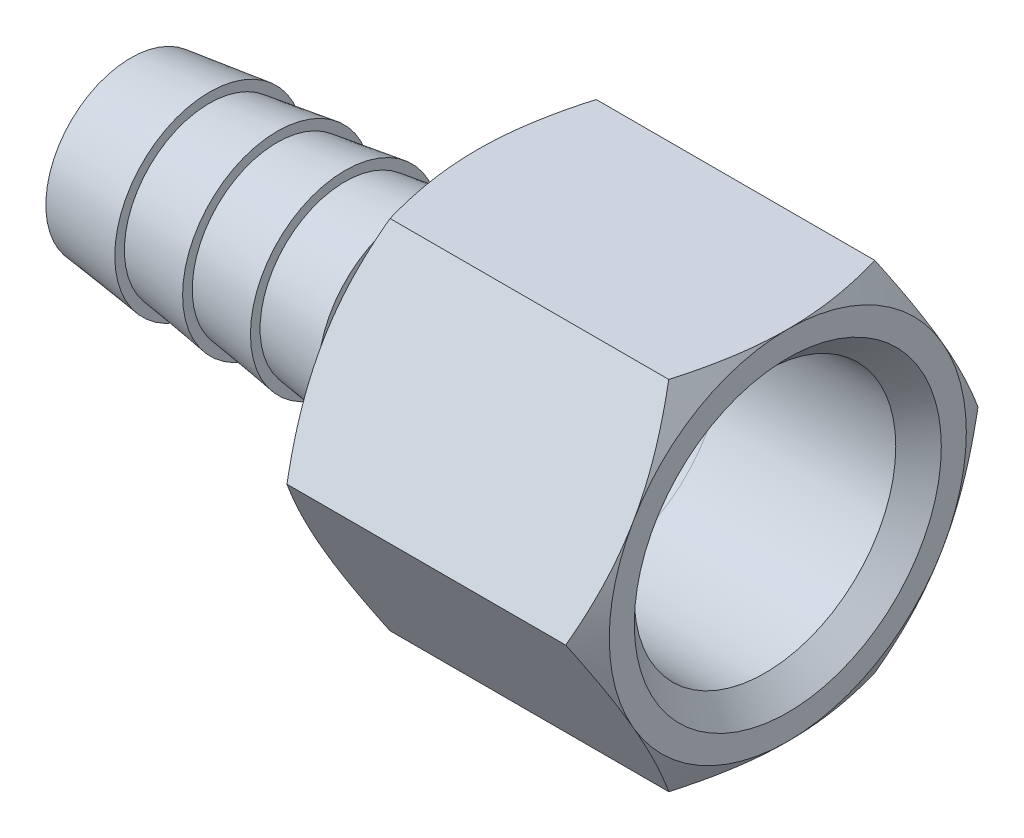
ISO-10303-21;
HEADER;
FILE_DESCRIPTION(('STEP AP214'),'2;1');
FILE_NAME('part.step','',(''),(''),'','','');
FILE_SCHEMA(('AUTOMOTIVE_DESIGN { 1 0 10303 214 1 1 1 1 }'));
ENDSEC;
DATA;
#1=APPLICATION_CONTEXT('core data for automotive mechanical design processes');
#2=APPLICATION_PROTOCOL_DEFINITION('international standard','automotive_design',2000,#1);
#3=PRODUCT_CONTEXT('',#1,'mechanical');
#4=PRODUCT('Part','Part','',(#3));
#5=PRODUCT_RELATED_PRODUCT_CATEGORY('part','',(#4));
#6=PRODUCT_DEFINITION_FORMATION('','',#4);
#7=PRODUCT_DEFINITION_CONTEXT('part definition',#1,'design');
#8=PRODUCT_DEFINITION('design','',#6,#7);
#9=PRODUCT_DEFINITION_SHAPE('','',#8);
#10=(LENGTH_UNIT() NAMED_UNIT(*) SI_UNIT(.MILLI.,.METRE.));
#11=(NAMED_UNIT(*) PLANE_ANGLE_UNIT() SI_UNIT($,.RADIAN.));
#12=(NAMED_UNIT(*) SI_UNIT($,.STERADIAN.) SOLID_ANGLE_UNIT());
#13=UNCERTAINTY_MEASURE_WITH_UNIT(LENGTH_MEASURE(1.E-05),#10,'distance_accuracy_value','');
#14=(GEOMETRIC_REPRESENTATION_CONTEXT(3) GLOBAL_UNCERTAINTY_ASSIGNED_CONTEXT((#13)) GLOBAL_UNIT_ASSIGNED_CONTEXT((#10,
#11,#12)) REPRESENTATION_CONTEXT('',''));
#15=CARTESIAN_POINT('',(0.,0.,0.));
#16=DIRECTION('',(0.,0.,1.));
#17=DIRECTION('',(1.,0.,0.));
#18=AXIS2_PLACEMENT_3D('',#15,#16,#17);
#19=CARTESIAN_POINT('',(24.6380000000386,0.,0.));
#20=DIRECTION('',(1.,0.,0.));
#21=DIRECTION('',(0.,0.,-1.));
#22=AXIS2_PLACEMENT_3D('',#19,#20,#21);
#23=CONICAL_SURFACE('',#22,6.73099999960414,0.148889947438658);
#24=CARTESIAN_POINT('',(20.0659999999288,0.,0.));
#25=DIRECTION('',(1.,0.,0.));
#26=DIRECTION('',(0.,0.,-1.));
#27=AXIS2_PLACEMENT_3D('',#24,#25,#26);
#28=CIRCLE('',#27,6.04520000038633);
#29=CARTESIAN_POINT('',(20.0659999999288,0.,-6.04520000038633));
#30=VERTEX_POINT('',#29);
#31=EDGE_CURVE('E133',#30,#30,#28,.F.);
#32=ORIENTED_EDGE('',*,*,#31,.F.);
#33=EDGE_LOOP('',(#32));
#34=FACE_BOUND('',#33,.T.);
#35=CARTESIAN_POINT('',(24.6380000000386,0.,0.));
#36=DIRECTION('',(1.,0.,0.));
#37=DIRECTION('',(0.,0.,-1.));
#38=AXIS2_PLACEMENT_3D('',#35,#36,#37);
#39=CIRCLE('',#38,6.73099999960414);
#40=CARTESIAN_POINT('',(24.6380000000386,0.,-6.73099999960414));
#41=VERTEX_POINT('',#40);
#42=EDGE_CURVE('E20',#41,#41,#39,.F.);
#43=ORIENTED_EDGE('',*,*,#42,.T.);
#44=EDGE_LOOP('',(#43));
#45=FACE_BOUND('',#44,.T.);
#46=ADVANCED_FACE('F16',(#34,#45),#23,.T.);
#47=CARTESIAN_POINT('',(24.638,0.,0.));
#48=DIRECTION('',(1.,0.,0.));
#49=DIRECTION('',(0.,0.,-1.));
#50=AXIS2_PLACEMENT_3D('',#47,#48,#49);
#51=PLANE('',#50);
#52=ORIENTED_EDGE('',*,*,#42,.F.);
#53=EDGE_LOOP('',(#52));
#54=FACE_BOUND('',#53,.T.);
#55=CARTESIAN_POINT('',(24.6379999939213,0.,0.));
#56=DIRECTION('',(1.,0.,0.));
#57=DIRECTION('',(0.,0.,-1.));
#58=AXIS2_PLACEMENT_3D('',#55,#56,#57);
#59=CIRCLE('',#58,12.7000000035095);
#60=CARTESIAN_POINT('',(24.6379999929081,6.35000000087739,10.998522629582));
#61=VERTEX_POINT('',#60);
#62=CARTESIAN_POINT('',(24.6379999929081,-6.35000000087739,10.998522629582));
#63=VERTEX_POINT('',#62);
#64=EDGE_CURVE('E125',#61,#63,#59,.T.);
#65=ORIENTED_EDGE('',*,*,#64,.F.);
#66=CARTESIAN_POINT('',(24.6379999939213,0.,0.));
#67=DIRECTION('',(1.,0.,0.));
#68=DIRECTION('',(0.,0.,-1.));
#69=AXIS2_PLACEMENT_3D('',#66,#67,#68);
#70=CIRCLE('',#69,12.7000000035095);
#71=CARTESIAN_POINT('',(24.6379999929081,12.7000000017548,0.));
#72=VERTEX_POINT('',#71);
#73=EDGE_CURVE('E103',#72,#61,#70,.T.);
#74=ORIENTED_EDGE('',*,*,#73,.F.);
#75=CARTESIAN_POINT('',(24.6379999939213,0.,0.));
#76=DIRECTION('',(1.,0.,0.));
#77=DIRECTION('',(0.,0.,-1.));
#78=AXIS2_PLACEMENT_3D('',#75,#76,#77);
#79=CIRCLE('',#78,12.7000000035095);
#80=CARTESIAN_POINT('',(24.6379999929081,6.35000000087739,-10.998522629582));
#81=VERTEX_POINT('',#80);
#82=EDGE_CURVE('E113',#81,#72,#79,.T.);
#83=ORIENTED_EDGE('',*,*,#82,.F.);
#84=CARTESIAN_POINT('',(24.6379999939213,0.,0.));
#85=DIRECTION('',(1.,0.,0.));
#86=DIRECTION('',(0.,0.,-1.));
#87=AXIS2_PLACEMENT_3D('',#84,#85,#86);
#88=CIRCLE('',#87,12.7000000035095);
#89=CARTESIAN_POINT('',(24.6379999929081,-6.3500000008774,-10.998522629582));
#90=VERTEX_POINT('',#89);
#91=EDGE_CURVE('E469',#90,#81,#88,.T.);
#92=ORIENTED_EDGE('',*,*,#91,.F.);
#93=CARTESIAN_POINT('',(24.6379999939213,0.,0.));
#94=DIRECTION('',(1.,0.,0.));
#95=DIRECTION('',(0.,0.,-1.));
#96=AXIS2_PLACEMENT_3D('',#93,#94,#95);
#97=CIRCLE('',#96,12.7000000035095);
#98=CARTESIAN_POINT('',(24.6379999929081,-12.7000000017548,0.));
#99=VERTEX_POINT('',#98);
#100=EDGE_CURVE('E448',#99,#90,#97,.T.);
#101=ORIENTED_EDGE('',*,*,#100,.F.);
#102=CARTESIAN_POINT('',(24.6379999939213,0.,0.));
#103=DIRECTION('',(1.,0.,0.));
#104=DIRECTION('',(0.,0.,-1.));
#105=AXIS2_PLACEMENT_3D('',#102,#103,#104);
#106=CIRCLE('',#105,12.7000000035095);
#107=EDGE_CURVE('E128',#63,#99,#106,.T.);
#108=ORIENTED_EDGE('',*,*,#107,.F.);
#109=EDGE_LOOP('',(#65,#74,#83,#92,#101,#108));
#110=FACE_BOUND('',#109,.T.);
#111=ADVANCED_FACE('F126',(#54,#110),#51,.F.);
#112=CARTESIAN_POINT('',(20.066,0.,3.3655));
#113=DIRECTION('',(1.,0.,0.));
#114=DIRECTION('',(0.,0.,-1.));
#115=AXIS2_PLACEMENT_3D('',#112,#113,#114);
#116=PLANE('',#115);
#117=ORIENTED_EDGE('',*,*,#31,.T.);
#118=EDGE_LOOP('',(#117));
#119=FACE_BOUND('',#118,.T.);
#120=CARTESIAN_POINT('',(20.0660000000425,0.,0.));
#121=DIRECTION('',(1.,0.,0.));
#122=DIRECTION('',(0.,0.,-1.));
#123=AXIS2_PLACEMENT_3D('',#120,#121,#122);
#124=CIRCLE('',#123,6.73099999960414);
#125=CARTESIAN_POINT('',(20.0660000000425,0.,-6.73099999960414));
#126=VERTEX_POINT('',#125);
#127=EDGE_CURVE('E112',#126,#126,#124,.F.);
#128=ORIENTED_EDGE('',*,*,#127,.F.);
#129=EDGE_LOOP('',(#128));
#130=FACE_BOUND('',#129,.T.);
#131=ADVANCED_FACE('F163',(#119,#130),#116,.T.);
#132=CARTESIAN_POINT('',(25.7791241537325,0.,0.));
#133=DIRECTION('',(1.,0.,0.));
#134=DIRECTION('',(0.,0.,-1.));
#135=AXIS2_PLACEMENT_3D('',#132,#133,#134);
#136=CONICAL_SURFACE('',#135,14.6764850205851,1.04719755);
#137=ORIENTED_EDGE('',*,*,#64,.T.);
#138=CARTESIAN_POINT('',(25.7723182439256,1.46751124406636E-09,14.6646968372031));
#139=CARTESIAN_POINT('',(25.5999623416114,-0.517124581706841,14.3661348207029));
#140=CARTESIAN_POINT('',(25.442074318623,-1.03804462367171,14.0653814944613));
#141=CARTESIAN_POINT('',(25.2330743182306,-1.82353998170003,13.6118755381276));
#142=CARTESIAN_POINT('',(25.1681721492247,-2.08540809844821,13.4606859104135));
#143=CARTESIAN_POINT('',(25.0483965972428,-2.61086106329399,13.1573154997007));
#144=CARTESIAN_POINT('',(24.993522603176,-2.87444580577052,13.0051347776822));
#145=CARTESIAN_POINT('',(24.8946778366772,-3.40347668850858,12.6996986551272));
#146=CARTESIAN_POINT('',(24.8507202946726,-3.66892469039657,12.54644217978));
#147=CARTESIAN_POINT('',(24.7746319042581,-4.20109031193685,12.2391962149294));
#148=CARTESIAN_POINT('',(24.7425007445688,-4.46780789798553,12.0852067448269));
#149=CARTESIAN_POINT('',(24.6906248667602,-5.00350072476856,11.775924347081));
#150=CARTESIAN_POINT('',(24.6709431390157,-5.27248057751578,11.6206287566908));
#151=CARTESIAN_POINT('',(24.64460329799,-5.81096927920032,11.3097321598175));
#152=CARTESIAN_POINT('',(24.6379477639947,-6.08047822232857,11.1541310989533));
#153=CARTESIAN_POINT('',(24.6379999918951,-6.34999999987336,10.9985226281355));
#154=B_SPLINE_CURVE_WITH_KNOTS('',3,(#138,#139,#140,#141,#142,#143,#144,#145,#146,#147,#148,
#149,#150,#151,#152,#153),.UNSPECIFIED.,.F.,.F.,(4,2,2,2,2,2,2,4),(0.,1.8644531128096,
2.79212421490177,3.71973876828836,4.64847213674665,5.57718105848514,6.51055215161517,
7.4441080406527),.UNSPECIFIED.);
#155=CARTESIAN_POINT('',(25.7723182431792,-5.73502257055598E-10,14.6646968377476));
#156=VERTEX_POINT('',#155);
#157=EDGE_CURVE('E136',#156,#63,#154,.T.);
#158=ORIENTED_EDGE('',*,*,#157,.F.);
#159=CARTESIAN_POINT('',(24.6379999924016,6.34999999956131,10.9985226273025));
#160=CARTESIAN_POINT('',(24.6379477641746,6.08047822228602,11.1541310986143));
#161=CARTESIAN_POINT('',(24.6446032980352,5.8109692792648,11.3097321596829));
#162=CARTESIAN_POINT('',(24.6709431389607,5.27248057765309,11.6206287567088));
#163=CARTESIAN_POINT('',(24.6906248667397,5.00350072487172,11.7759243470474));
#164=CARTESIAN_POINT('',(24.742500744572,4.46780789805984,12.0852067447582));
#165=CARTESIAN_POINT('',(24.7746319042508,4.20109031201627,12.239196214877));
#166=CARTESIAN_POINT('',(24.8507202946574,3.66892469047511,12.5464421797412));
#167=CARTESIAN_POINT('',(24.8946778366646,3.40347668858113,12.6996986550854));
#168=CARTESIAN_POINT('',(24.9935226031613,2.87444580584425,13.0051347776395));
#169=CARTESIAN_POINT('',(25.0483965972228,2.61086106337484,13.1573154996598));
#170=CARTESIAN_POINT('',(25.1681721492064,2.08540809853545,13.4606859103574));
#171=CARTESIAN_POINT('',(25.2330743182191,1.82353998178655,13.6118755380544));
#172=CARTESIAN_POINT('',(25.4420743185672,1.03804462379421,14.0653814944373));
#173=CARTESIAN_POINT('',(25.5999623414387,0.517124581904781,14.3661348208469));
#174=CARTESIAN_POINT('',(25.7723182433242,-1.0082244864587E-09,14.6646968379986));
#175=B_SPLINE_CURVE_WITH_KNOTS('',3,(#159,#160,#161,#162,#163,#164,#165,#166,#167,#168,#169,
#170,#171,#172,#173,#174),.UNSPECIFIED.,.F.,.F.,(4,2,2,2,2,2,2,4),(0.,0.933555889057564,
1.86692698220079,2.79563590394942,3.72436927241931,4.65198382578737,5.57965492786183,
7.44410804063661),.UNSPECIFIED.);
#176=EDGE_CURVE('E118',#61,#156,#175,.T.);
#177=ORIENTED_EDGE('',*,*,#176,.F.);
#178=EDGE_LOOP('',(#137,#158,#177));
#179=FACE_BOUND('',#178,.T.);
#180=ADVANCED_FACE('F135',(#179),#136,.T.);
#181=CARTESIAN_POINT('',(25.7791241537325,0.,0.));
#182=DIRECTION('',(1.,0.,0.));
#183=DIRECTION('',(0.,0.,-1.));
#184=AXIS2_PLACEMENT_3D('',#181,#182,#183);
#185=CONICAL_SURFACE('',#184,14.6764850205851,1.04719755);
#186=ORIENTED_EDGE('',*,*,#107,.T.);
#187=CARTESIAN_POINT('',(25.7723182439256,-12.6999999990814,7.33234841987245));
#188=CARTESIAN_POINT('',(25.5999623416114,-12.6999999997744,6.73522438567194));
#189=CARTESIAN_POINT('',(25.442074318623,-12.6999999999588,6.13371773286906));
#190=CARTESIAN_POINT('',(25.2330743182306,-12.7000000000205,5.22670582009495));
#191=CARTESIAN_POINT('',(25.1681721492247,-12.7000000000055,4.92432656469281));
#192=CARTESIAN_POINT('',(25.0483965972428,-12.6999999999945,4.31758574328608));
#193=CARTESIAN_POINT('',(24.993522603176,-12.6999999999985,4.01322429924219));
#194=CARTESIAN_POINT('',(24.8946778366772,-12.7000000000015,3.402352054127));
#195=CARTESIAN_POINT('',(24.8507202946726,-12.7000000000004,3.09583910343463));
#196=CARTESIAN_POINT('',(24.7746319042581,-12.6999999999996,2.48134717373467));
#197=CARTESIAN_POINT('',(24.7425007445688,-12.6999999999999,2.17336823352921));
#198=CARTESIAN_POINT('',(24.6906248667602,-12.7000000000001,1.55480343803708));
#199=CARTESIAN_POINT('',(24.6709431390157,-12.7000000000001,1.24421225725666));
#200=CARTESIAN_POINT('',(24.64460329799,-12.6999999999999,0.622419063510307));
#201=CARTESIAN_POINT('',(24.6379477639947,-12.6999999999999,0.311216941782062));
#202=CARTESIAN_POINT('',(24.6379999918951,-12.7,1.46230937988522E-10));
#203=B_SPLINE_CURVE_WITH_KNOTS('',3,(#187,#188,#189,#190,#191,#192,#193,#194,#195,#196,#197,
#198,#199,#200,#201,#202),.UNSPECIFIED.,.F.,.F.,(4,2,2,2,2,2,2,4),(0.,1.8644531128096,
2.79212421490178,3.71973876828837,4.64847213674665,5.57718105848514,6.51055215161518,
7.4441080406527),.UNSPECIFIED.);
#204=CARTESIAN_POINT('',(25.7723182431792,-12.7000000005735,7.33234841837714));
#205=VERTEX_POINT('',#204);
#206=EDGE_CURVE('E242',#205,#99,#203,.T.);
#207=ORIENTED_EDGE('',*,*,#206,.F.);
#208=CARTESIAN_POINT('',(24.6379999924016,-6.34999999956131,10.9985226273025));
#209=CARTESIAN_POINT('',(24.6379477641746,-6.619521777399,10.8429141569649));
#210=CARTESIAN_POINT('',(24.6446032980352,-6.88903072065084,10.6873130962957));
#211=CARTESIAN_POINT('',(24.6709431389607,-7.42751942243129,10.376416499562));
#212=CARTESIAN_POINT('',(24.6906248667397,-7.69649927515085,10.2211209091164));
#213=CARTESIAN_POINT('',(24.742500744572,-8.23219210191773,9.91183851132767));
#214=CARTESIAN_POINT('',(24.7746319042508,-8.49890968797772,9.75784904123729));
#215=CARTESIAN_POINT('',(24.8507202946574,-9.03107530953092,9.45060307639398));
#216=CARTESIAN_POINT('',(24.8946778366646,-9.29652331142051,9.29734660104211));
#217=CARTESIAN_POINT('',(24.9935226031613,-9.82555419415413,8.99191047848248));
#218=CARTESIAN_POINT('',(25.0483965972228,-10.0891389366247,8.83972975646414));
#219=CARTESIAN_POINT('',(25.1681721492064,-10.614591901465,8.5363593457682));
#220=CARTESIAN_POINT('',(25.2330743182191,-10.8764600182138,8.38516971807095));
#221=CARTESIAN_POINT('',(25.4420743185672,-11.6619553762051,7.9316637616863));
#222=CARTESIAN_POINT('',(25.5999623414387,-12.1828754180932,7.63091043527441));
#223=CARTESIAN_POINT('',(25.7723182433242,-12.7000000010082,7.33234841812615));
#224=B_SPLINE_CURVE_WITH_KNOTS('',3,(#208,#209,#210,#211,#212,#213,#214,#215,#216,#217,#218,
#219,#220,#221,#222,#223),.UNSPECIFIED.,.F.,.F.,(4,2,2,2,2,2,2,4),(0.,0.93355588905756,
1.86692698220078,2.79563590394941,3.72436927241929,4.65198382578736,5.57965492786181,
7.44410804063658),.UNSPECIFIED.);
#225=EDGE_CURVE('E243',#63,#205,#224,.T.);
#226=ORIENTED_EDGE('',*,*,#225,.F.);
#227=EDGE_LOOP('',(#186,#207,#226));
#228=FACE_BOUND('',#227,.T.);
#229=ADVANCED_FACE('F162',(#228),#185,.T.);
#230=CARTESIAN_POINT('',(25.7791241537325,0.,0.));
#231=DIRECTION('',(1.,0.,0.));
#232=DIRECTION('',(0.,0.,-1.));
#233=AXIS2_PLACEMENT_3D('',#230,#231,#232);
#234=CONICAL_SURFACE('',#233,14.6764850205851,1.04719755);
#235=CARTESIAN_POINT('',(24.6379999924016,-12.6999999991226,0.));
#236=CARTESIAN_POINT('',(24.6379477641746,-12.699999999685,-0.31121694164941));
#237=CARTESIAN_POINT('',(24.6446032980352,-12.6999999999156,-0.62241906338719));
#238=CARTESIAN_POINT('',(24.6709431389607,-12.7000000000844,-1.24421225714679));
#239=CARTESIAN_POINT('',(24.6906248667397,-12.7000000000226,-1.55480343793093));
#240=CARTESIAN_POINT('',(24.742500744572,-12.6999999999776,-2.17336823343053));
#241=CARTESIAN_POINT('',(24.7746319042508,-12.699999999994,-2.48134717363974));
#242=CARTESIAN_POINT('',(24.8507202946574,-12.700000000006,-3.0958391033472));
#243=CARTESIAN_POINT('',(24.8946778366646,-12.7000000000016,-3.40235205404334));
#244=CARTESIAN_POINT('',(24.9935226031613,-12.6999999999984,-4.01322429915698));
#245=CARTESIAN_POINT('',(25.0483965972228,-12.6999999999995,-4.31758574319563));
#246=CARTESIAN_POINT('',(25.1681721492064,-12.7000000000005,-4.9243265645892));
#247=CARTESIAN_POINT('',(25.2330743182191,-12.7000000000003,-5.22670581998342));
#248=CARTESIAN_POINT('',(25.4420743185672,-12.6999999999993,-6.13371773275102));
#249=CARTESIAN_POINT('',(25.5999623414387,-12.699999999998,-6.73522438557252));
#250=CARTESIAN_POINT('',(25.7723182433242,-12.7,-7.33234841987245));
#251=B_SPLINE_CURVE_WITH_KNOTS('',3,(#235,#236,#237,#238,#239,#240,#241,#242,#243,#244,#245,
#246,#247,#248,#249,#250),.UNSPECIFIED.,.F.,.F.,(4,2,2,2,2,2,2,4),(0.,0.933555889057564,
1.86692698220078,2.79563590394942,3.7243692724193,4.65198382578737,5.57965492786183,
7.4441080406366),.UNSPECIFIED.);
#252=CARTESIAN_POINT('',(25.7723182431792,-12.7,-7.33234841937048));
#253=VERTEX_POINT('',#252);
#254=EDGE_CURVE('E239',#99,#253,#251,.T.);
#255=ORIENTED_EDGE('',*,*,#254,.F.);
#256=ORIENTED_EDGE('',*,*,#100,.T.);
#257=CARTESIAN_POINT('',(25.7723182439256,-12.7000000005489,-7.33234841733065));
#258=CARTESIAN_POINT('',(25.5999623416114,-12.1828754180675,-7.63091043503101));
#259=CARTESIAN_POINT('',(25.442074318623,-11.6619553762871,-7.9316637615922));
#260=CARTESIAN_POINT('',(25.2330743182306,-10.8764600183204,-8.38516971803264));
#261=CARTESIAN_POINT('',(25.1681721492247,-10.6145919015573,-8.53635934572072));
#262=CARTESIAN_POINT('',(25.0483965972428,-10.0891389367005,-8.83972975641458));
#263=CARTESIAN_POINT('',(24.993522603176,-9.825554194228,-8.99191047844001));
#264=CARTESIAN_POINT('',(24.8946778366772,-9.29652331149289,-9.29734660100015));
#265=CARTESIAN_POINT('',(24.8507202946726,-9.03107530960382,-9.45060307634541));
#266=CARTESIAN_POINT('',(24.7746319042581,-8.49890968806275,-9.7578490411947));
#267=CARTESIAN_POINT('',(24.7425007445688,-8.23219210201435,-9.91183851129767));
#268=CARTESIAN_POINT('',(24.6906248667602,-7.69649927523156,-10.2211209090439));
#269=CARTESIAN_POINT('',(24.6709431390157,-7.42751942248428,-10.3764164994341));
#270=CARTESIAN_POINT('',(24.64460329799,-6.88903072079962,-10.6873130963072));
#271=CARTESIAN_POINT('',(24.6379477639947,-6.61952177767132,-10.8429141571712));
#272=CARTESIAN_POINT('',(24.6379999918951,-6.35000000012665,-10.9985226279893));
#273=B_SPLINE_CURVE_WITH_KNOTS('',3,(#257,#258,#259,#260,#261,#262,#263,#264,#265,#266,#267,
#268,#269,#270,#271,#272),.UNSPECIFIED.,.F.,.F.,(4,2,2,2,2,2,2,4),(0.,1.8644531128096,
2.79212421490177,3.71973876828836,4.64847213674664,5.57718105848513,6.51055215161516,
7.44410804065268),.UNSPECIFIED.);
#274=EDGE_CURVE('E238',#253,#90,#273,.T.);
#275=ORIENTED_EDGE('',*,*,#274,.F.);
#276=EDGE_LOOP('',(#255,#256,#275));
#277=FACE_BOUND('',#276,.T.);
#278=ADVANCED_FACE('F434',(#277),#234,.T.);
#279=CARTESIAN_POINT('',(25.7791241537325,0.,0.));
#280=DIRECTION('',(1.,0.,0.));
#281=DIRECTION('',(0.,0.,-1.));
#282=AXIS2_PLACEMENT_3D('',#279,#280,#281);
#283=CONICAL_SURFACE('',#282,14.6764850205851,1.04719755);
#284=CARTESIAN_POINT('',(24.6379999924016,-6.34999999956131,-10.9985226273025));
#285=CARTESIAN_POINT('',(24.6379477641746,-6.08047822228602,-11.1541310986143));
#286=CARTESIAN_POINT('',(24.6446032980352,-5.8109692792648,-11.3097321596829));
#287=CARTESIAN_POINT('',(24.6709431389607,-5.27248057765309,-11.6206287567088));
#288=CARTESIAN_POINT('',(24.6906248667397,-5.00350072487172,-11.7759243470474));
#289=CARTESIAN_POINT('',(24.742500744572,-4.46780789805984,-12.0852067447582));
#290=CARTESIAN_POINT('',(24.7746319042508,-4.20109031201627,-12.239196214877));
#291=CARTESIAN_POINT('',(24.8507202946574,-3.66892469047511,-12.5464421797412));
#292=CARTESIAN_POINT('',(24.8946778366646,-3.40347668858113,-12.6996986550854));
#293=CARTESIAN_POINT('',(24.9935226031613,-2.87444580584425,-13.0051347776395));
#294=CARTESIAN_POINT('',(25.0483965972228,-2.61086106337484,-13.1573154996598));
#295=CARTESIAN_POINT('',(25.1681721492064,-2.08540809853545,-13.4606859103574));
#296=CARTESIAN_POINT('',(25.2330743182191,-1.82353998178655,-13.6118755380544));
#297=CARTESIAN_POINT('',(25.4420743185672,-1.0380446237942,-14.0653814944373));
#298=CARTESIAN_POINT('',(25.5999623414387,-0.517124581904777,-14.3661348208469));
#299=CARTESIAN_POINT('',(25.7723182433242,1.00822567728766E-09,-14.6646968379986));
#300=B_SPLINE_CURVE_WITH_KNOTS('',3,(#284,#285,#286,#287,#288,#289,#290,#291,#292,#293,#294,
#295,#296,#297,#298,#299),.UNSPECIFIED.,.F.,.F.,(4,2,2,2,2,2,2,4),(0.,0.933555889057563,
1.86692698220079,2.79563590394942,3.72436927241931,4.65198382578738,5.57965492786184,
7.44410804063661),.UNSPECIFIED.);
#301=CARTESIAN_POINT('',(25.7723182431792,5.73502584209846E-10,-14.6646968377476));
#302=VERTEX_POINT('',#301);
#303=EDGE_CURVE('E234',#90,#302,#300,.T.);
#304=ORIENTED_EDGE('',*,*,#303,.F.);
#305=ORIENTED_EDGE('',*,*,#91,.T.);
#306=CARTESIAN_POINT('',(25.7723182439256,-1.46750965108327E-09,-14.6646968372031));
#307=CARTESIAN_POINT('',(25.5999623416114,0.51712458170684,-14.3661348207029));
#308=CARTESIAN_POINT('',(25.442074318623,1.03804462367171,-14.0653814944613));
#309=CARTESIAN_POINT('',(25.2330743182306,1.82353998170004,-13.6118755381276));
#310=CARTESIAN_POINT('',(25.1681721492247,2.08540809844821,-13.4606859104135));
#311=CARTESIAN_POINT('',(25.0483965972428,2.61086106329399,-13.1573154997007));
#312=CARTESIAN_POINT('',(24.993522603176,2.87444580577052,-13.0051347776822));
#313=CARTESIAN_POINT('',(24.8946778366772,3.40347668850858,-12.6996986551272));
#314=CARTESIAN_POINT('',(24.8507202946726,3.66892469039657,-12.54644217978));
#315=CARTESIAN_POINT('',(24.7746319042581,4.20109031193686,-12.2391962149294));
#316=CARTESIAN_POINT('',(24.7425007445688,4.46780789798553,-12.0852067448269));
#317=CARTESIAN_POINT('',(24.6906248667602,5.00350072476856,-11.775924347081));
#318=CARTESIAN_POINT('',(24.6709431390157,5.27248057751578,-11.6206287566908));
#319=CARTESIAN_POINT('',(24.64460329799,5.81096927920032,-11.3097321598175));
#320=CARTESIAN_POINT('',(24.6379477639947,6.08047822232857,-11.1541310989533));
#321=CARTESIAN_POINT('',(24.6379999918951,6.34999999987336,-10.9985226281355));
#322=B_SPLINE_CURVE_WITH_KNOTS('',3,(#306,#307,#308,#309,#310,#311,#312,#313,#314,#315,#316,
#317,#318,#319,#320,#321),.UNSPECIFIED.,.F.,.F.,(4,2,2,2,2,2,2,4),(0.,1.8644531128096,
2.79212421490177,3.71973876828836,4.64847213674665,5.57718105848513,6.51055215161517,
7.44410804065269),.UNSPECIFIED.);
#323=EDGE_CURVE('E233',#302,#81,#322,.T.);
#324=ORIENTED_EDGE('',*,*,#323,.F.);
#325=EDGE_LOOP('',(#304,#305,#324));
#326=FACE_BOUND('',#325,.T.);
#327=ADVANCED_FACE('F333',(#326),#283,.T.);
#328=CARTESIAN_POINT('',(25.7791241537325,0.,0.));
#329=DIRECTION('',(1.,0.,0.));
#330=DIRECTION('',(0.,0.,-1.));
#331=AXIS2_PLACEMENT_3D('',#328,#329,#330);
#332=CONICAL_SURFACE('',#331,14.6764850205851,1.04719755);
#333=CARTESIAN_POINT('',(24.6379999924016,6.34999999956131,-10.9985226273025));
#334=CARTESIAN_POINT('',(24.6379477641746,6.619521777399,-10.8429141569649));
#335=CARTESIAN_POINT('',(24.6446032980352,6.88903072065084,-10.6873130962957));
#336=CARTESIAN_POINT('',(24.6709431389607,7.42751942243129,-10.376416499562));
#337=CARTESIAN_POINT('',(24.6906248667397,7.69649927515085,-10.2211209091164));
#338=CARTESIAN_POINT('',(24.742500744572,8.23219210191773,-9.91183851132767));
#339=CARTESIAN_POINT('',(24.7746319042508,8.49890968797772,-9.75784904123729));
#340=CARTESIAN_POINT('',(24.8507202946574,9.03107530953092,-9.45060307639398));
#341=CARTESIAN_POINT('',(24.8946778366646,9.29652331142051,-9.29734660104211));
#342=CARTESIAN_POINT('',(24.9935226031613,9.82555419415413,-8.99191047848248));
#343=CARTESIAN_POINT('',(25.0483965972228,10.0891389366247,-8.83972975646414));
#344=CARTESIAN_POINT('',(25.1681721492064,10.614591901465,-8.5363593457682));
#345=CARTESIAN_POINT('',(25.2330743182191,10.8764600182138,-8.38516971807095));
#346=CARTESIAN_POINT('',(25.4420743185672,11.6619553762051,-7.9316637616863));
#347=CARTESIAN_POINT('',(25.5999623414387,12.1828754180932,-7.63091043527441));
#348=CARTESIAN_POINT('',(25.7723182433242,12.7000000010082,-7.33234841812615));
#349=B_SPLINE_CURVE_WITH_KNOTS('',3,(#333,#334,#335,#336,#337,#338,#339,#340,#341,#342,#343,
#344,#345,#346,#347,#348),.UNSPECIFIED.,.F.,.F.,(4,2,2,2,2,2,2,4),(0.,0.93355588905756,
1.86692698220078,2.79563590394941,3.72436927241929,4.65198382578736,5.57965492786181,
7.44410804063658),.UNSPECIFIED.);
#350=CARTESIAN_POINT('',(25.7723182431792,12.7000000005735,-7.33234841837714));
#351=VERTEX_POINT('',#350);
#352=EDGE_CURVE('E229',#81,#351,#349,.T.);
#353=ORIENTED_EDGE('',*,*,#352,.F.);
#354=ORIENTED_EDGE('',*,*,#82,.T.);
#355=CARTESIAN_POINT('',(25.7723182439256,12.6999999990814,-7.33234841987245));
#356=CARTESIAN_POINT('',(25.5999623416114,12.6999999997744,-6.73522438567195));
#357=CARTESIAN_POINT('',(25.442074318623,12.6999999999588,-6.13371773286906));
#358=CARTESIAN_POINT('',(25.2330743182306,12.7000000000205,-5.22670582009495));
#359=CARTESIAN_POINT('',(25.1681721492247,12.7000000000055,-4.92432656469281));
#360=CARTESIAN_POINT('',(25.0483965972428,12.6999999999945,-4.31758574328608));
#361=CARTESIAN_POINT('',(24.993522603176,12.6999999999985,-4.01322429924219));
#362=CARTESIAN_POINT('',(24.8946778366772,12.7000000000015,-3.40235205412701));
#363=CARTESIAN_POINT('',(24.8507202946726,12.7000000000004,-3.09583910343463));
#364=CARTESIAN_POINT('',(24.7746319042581,12.6999999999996,-2.48134717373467));
#365=CARTESIAN_POINT('',(24.7425007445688,12.6999999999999,-2.17336823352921));
#366=CARTESIAN_POINT('',(24.6906248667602,12.7000000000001,-1.55480343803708));
#367=CARTESIAN_POINT('',(24.6709431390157,12.7000000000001,-1.24421225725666));
#368=CARTESIAN_POINT('',(24.64460329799,12.6999999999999,-0.622419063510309));
#369=CARTESIAN_POINT('',(24.6379477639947,12.6999999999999,-0.311216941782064));
#370=CARTESIAN_POINT('',(24.6379999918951,12.7,-1.46233377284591E-10));
#371=B_SPLINE_CURVE_WITH_KNOTS('',3,(#355,#356,#357,#358,#359,#360,#361,#362,#363,#364,#365,
#366,#367,#368,#369,#370),.UNSPECIFIED.,.F.,.F.,(4,2,2,2,2,2,2,4),(0.,1.8644531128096,
2.79212421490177,3.71973876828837,4.64847213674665,5.57718105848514,6.51055215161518,
7.4441080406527),.UNSPECIFIED.);
#372=EDGE_CURVE('E228',#351,#72,#371,.T.);
#373=ORIENTED_EDGE('',*,*,#372,.F.);
#374=EDGE_LOOP('',(#353,#354,#373));
#375=FACE_BOUND('',#374,.T.);
#376=ADVANCED_FACE('F328',(#375),#332,.T.);
#377=CARTESIAN_POINT('',(25.7791241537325,0.,0.));
#378=DIRECTION('',(1.,0.,0.));
#379=DIRECTION('',(0.,0.,-1.));
#380=AXIS2_PLACEMENT_3D('',#377,#378,#379);
#381=CONICAL_SURFACE('',#380,14.6764850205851,1.04719755);
#382=ORIENTED_EDGE('',*,*,#73,.T.);
#383=CARTESIAN_POINT('',(25.7723182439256,12.7000000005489,7.33234841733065));
#384=CARTESIAN_POINT('',(25.5999623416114,12.1828754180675,7.63091043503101));
#385=CARTESIAN_POINT('',(25.442074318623,11.6619553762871,7.9316637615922));
#386=CARTESIAN_POINT('',(25.2330743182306,10.8764600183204,8.38516971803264));
#387=CARTESIAN_POINT('',(25.1681721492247,10.6145919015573,8.53635934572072));
#388=CARTESIAN_POINT('',(25.0483965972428,10.0891389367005,8.83972975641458));
#389=CARTESIAN_POINT('',(24.993522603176,9.825554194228,8.99191047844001));
#390=CARTESIAN_POINT('',(24.8946778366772,9.29652331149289,9.29734660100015));
#391=CARTESIAN_POINT('',(24.8507202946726,9.03107530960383,9.45060307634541));
#392=CARTESIAN_POINT('',(24.7746319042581,8.49890968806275,9.7578490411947));
#393=CARTESIAN_POINT('',(24.7425007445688,8.23219210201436,9.91183851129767));
#394=CARTESIAN_POINT('',(24.6906248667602,7.69649927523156,10.2211209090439));
#395=CARTESIAN_POINT('',(24.6709431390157,7.42751942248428,10.3764164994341));
#396=CARTESIAN_POINT('',(24.64460329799,6.88903072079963,10.6873130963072));
#397=CARTESIAN_POINT('',(24.6379477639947,6.61952177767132,10.8429141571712));
#398=CARTESIAN_POINT('',(24.6379999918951,6.35000000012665,10.9985226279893));
#399=B_SPLINE_CURVE_WITH_KNOTS('',3,(#383,#384,#385,#386,#387,#388,#389,#390,#391,#392,#393,
#394,#395,#396,#397,#398),.UNSPECIFIED.,.F.,.F.,(4,2,2,2,2,2,2,4),(0.,1.8644531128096,
2.79212421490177,3.71973876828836,4.64847213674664,5.57718105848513,6.51055215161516,
7.44410804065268),.UNSPECIFIED.);
#400=CARTESIAN_POINT('',(25.7723182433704,12.7000000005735,7.33234841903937));
#401=VERTEX_POINT('',#400);
#402=EDGE_CURVE('E106',#401,#61,#399,.T.);
#403=ORIENTED_EDGE('',*,*,#402,.F.);
#404=CARTESIAN_POINT('',(24.6379999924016,12.6999999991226,0.));
#405=CARTESIAN_POINT('',(24.6379477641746,12.699999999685,0.311216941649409));
#406=CARTESIAN_POINT('',(24.6446032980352,12.6999999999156,0.622419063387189));
#407=CARTESIAN_POINT('',(24.6709431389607,12.7000000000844,1.24421225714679));
#408=CARTESIAN_POINT('',(24.6906248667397,12.7000000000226,1.55480343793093));
#409=CARTESIAN_POINT('',(24.742500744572,12.6999999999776,2.17336823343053));
#410=CARTESIAN_POINT('',(24.7746319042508,12.699999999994,2.48134717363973));
#411=CARTESIAN_POINT('',(24.8507202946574,12.700000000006,3.0958391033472));
#412=CARTESIAN_POINT('',(24.8946778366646,12.7000000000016,3.40235205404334));
#413=CARTESIAN_POINT('',(24.9935226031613,12.6999999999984,4.01322429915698));
#414=CARTESIAN_POINT('',(25.0483965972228,12.6999999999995,4.31758574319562));
#415=CARTESIAN_POINT('',(25.1681721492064,12.7000000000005,4.9243265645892));
#416=CARTESIAN_POINT('',(25.2330743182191,12.7000000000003,5.22670581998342));
#417=CARTESIAN_POINT('',(25.4420743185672,12.6999999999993,6.13371773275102));
#418=CARTESIAN_POINT('',(25.5999623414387,12.699999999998,6.73522438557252));
#419=CARTESIAN_POINT('',(25.7723182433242,12.7,7.33234841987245));
#420=B_SPLINE_CURVE_WITH_KNOTS('',3,(#404,#405,#406,#407,#408,#409,#410,#411,#412,#413,#414,
#415,#416,#417,#418,#419),.UNSPECIFIED.,.F.,.F.,(4,2,2,2,2,2,2,4),(0.,0.933555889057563,
1.86692698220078,2.79563590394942,3.7243692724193,4.65198382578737,5.57965492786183,
7.4441080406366),.UNSPECIFIED.);
#421=EDGE_CURVE('E108',#72,#401,#420,.T.);
#422=ORIENTED_EDGE('',*,*,#421,.F.);
#423=EDGE_LOOP('',(#382,#403,#422));
#424=FACE_BOUND('',#423,.T.);
#425=ADVANCED_FACE('F105',(#424),#381,.T.);
#426=CARTESIAN_POINT('',(20.0660000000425,0.,0.));
#427=DIRECTION('',(1.,0.,0.));
#428=DIRECTION('',(0.,0.,-1.));
#429=AXIS2_PLACEMENT_3D('',#426,#427,#428);
#430=CONICAL_SURFACE('',#429,6.73099999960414,0.141160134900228);
#431=CARTESIAN_POINT('',(15.2399999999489,0.,0.));
#432=DIRECTION('',(1.,0.,0.));
#433=DIRECTION('',(0.,0.,-1.));
#434=AXIS2_PLACEMENT_3D('',#431,#432,#433);
#435=CIRCLE('',#434,6.04520000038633);
#436=CARTESIAN_POINT('',(15.2399999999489,0.,-6.04520000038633));
#437=VERTEX_POINT('',#436);
#438=EDGE_CURVE('E224',#437,#437,#435,.F.);
#439=ORIENTED_EDGE('',*,*,#438,.F.);
#440=EDGE_LOOP('',(#439));
#441=FACE_BOUND('',#440,.T.);
#442=ORIENTED_EDGE('',*,*,#127,.T.);
#443=EDGE_LOOP('',(#442));
#444=FACE_BOUND('',#443,.T.);
#445=ADVANCED_FACE('F327',(#441,#444),#430,.T.);
#446=CARTESIAN_POINT('',(24.638,0.,14.6646968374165));
#447=DIRECTION('',(0.,0.5,0.866025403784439));
#448=DIRECTION('',(0.,-0.866025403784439,0.5));
#449=AXIS2_PLACEMENT_3D('',#446,#447,#448);
#450=PLANE('',#449);
#451=ORIENTED_EDGE('',*,*,#176,.T.);
#452=DIRECTION('',(1.,0.,0.));
#453=VECTOR('',#452,1.);
#454=CARTESIAN_POINT('',(24.638,0.,14.6646968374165));
#455=LINE('',#454,#453);
#456=CARTESIAN_POINT('',(45.6016817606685,1.09696414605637E-08,14.6646968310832));
#457=VERTEX_POINT('',#456);
#458=EDGE_CURVE('E137',#457,#156,#455,.F.);
#459=ORIENTED_EDGE('',*,*,#458,.F.);
#460=CARTESIAN_POINT('',(46.7360000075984,6.34999999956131,10.9985226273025));
#461=CARTESIAN_POINT('',(46.7360522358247,6.0804782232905,11.1541310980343));
#462=CARTESIAN_POINT('',(46.729396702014,5.81096928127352,11.3097321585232));
#463=CARTESIAN_POINT('',(46.7030568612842,5.27248058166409,11.6206287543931));
#464=CARTESIAN_POINT('',(46.6833751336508,5.00350072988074,11.7759243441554));
#465=CARTESIAN_POINT('',(46.6314992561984,4.46780790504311,12.0852067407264));
#466=CARTESIAN_POINT('',(46.599368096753,4.20109031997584,12.2391962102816));
#467=CARTESIAN_POINT('',(46.5232797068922,3.66892470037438,12.5464421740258));
#468=CARTESIAN_POINT('',(46.4793221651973,3.40347669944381,12.6996986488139));
#469=CARTESIAN_POINT('',(46.3804773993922,2.87444581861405,13.0051347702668));
#470=CARTESIAN_POINT('',(46.3256034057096,2.61086107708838,13.1573154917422));
#471=CARTESIAN_POINT('',(46.2058278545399,2.08540811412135,13.4606859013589));
#472=CARTESIAN_POINT('',(46.1409256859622,1.82353999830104,13.6118755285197));
#473=CARTESIAN_POINT('',(45.9319256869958,1.0380446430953,14.0653814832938));
#474=CARTESIAN_POINT('',(45.7740376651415,0.517124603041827,14.3661348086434));
#475=CARTESIAN_POINT('',(45.601681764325,2.1939281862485E-08,14.6646968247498));
#476=B_SPLINE_CURVE_WITH_KNOTS('',3,(#460,#461,#462,#463,#464,#465,#466,#467,#468,#469,#470,
#471,#472,#473,#474,#475),.UNSPECIFIED.,.F.,.F.,(4,2,2,2,2,2,2,4),(0.,0.933555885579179,
1.8669269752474,2.79563589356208,3.72436925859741,4.65198380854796,5.5796549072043,
7.4441080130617),.UNSPECIFIED.);
#477=CARTESIAN_POINT('',(46.7360000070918,6.35000000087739,10.998522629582));
#478=VERTEX_POINT('',#477);
#479=EDGE_CURVE('E407',#478,#457,#476,.T.);
#480=ORIENTED_EDGE('',*,*,#479,.F.);
#481=CARTESIAN_POINT('',(45.6016817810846,12.6999999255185,7.3323484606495));
#482=CARTESIAN_POINT('',(45.7740376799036,12.1828753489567,7.63091047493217));
#483=CARTESIAN_POINT('',(45.9319256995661,11.6619553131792,7.93166379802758));
#484=CARTESIAN_POINT('',(46.140925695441,10.8764599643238,8.38516974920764));
#485=CARTESIAN_POINT('',(46.2058278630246,10.6145918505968,8.53635937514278));
#486=CARTESIAN_POINT('',(46.3256034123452,10.089138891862,8.83972978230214));
#487=CARTESIAN_POINT('',(46.3804774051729,9.82555415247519,8.99191050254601));
#488=CARTESIAN_POINT('',(46.4793221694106,9.29652327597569,9.29734662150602));
#489=CARTESIAN_POINT('',(46.5232797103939,9.03107527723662,9.45060309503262));
#490=CARTESIAN_POINT('',(46.599368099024,8.49890966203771,9.75784905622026));
#491=CARTESIAN_POINT('',(46.6314992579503,8.23219207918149,9.91183852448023));
#492=CARTESIAN_POINT('',(46.6833751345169,7.69649925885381,10.2211209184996));
#493=CARTESIAN_POINT('',(46.7030568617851,7.42751940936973,10.3764165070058));
#494=CARTESIAN_POINT('',(46.7293967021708,6.88903071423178,10.6873131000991));
#495=CARTESIAN_POINT('',(46.7360522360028,6.61952177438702,10.8429141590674));
#496=CARTESIAN_POINT('',(46.7360000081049,6.35000000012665,10.9985226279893));
#497=B_SPLINE_CURVE_WITH_KNOTS('',3,(#481,#482,#483,#484,#485,#486,#487,#488,#489,#490,#491,
#492,#493,#494,#495,#496),.UNSPECIFIED.,.F.,.F.,(4,2,2,2,2,2,2,4),(0.,1.8644530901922,
2.79212418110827,3.71973872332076,4.64847208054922,5.57718099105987,6.51055207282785,
7.44410795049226),.UNSPECIFIED.);
#498=CARTESIAN_POINT('',(45.6016817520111,12.7,7.33234843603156));
#499=VERTEX_POINT('',#498);
#500=EDGE_CURVE('E732',#499,#478,#497,.T.);
#501=ORIENTED_EDGE('',*,*,#500,.F.);
#502=DIRECTION('',(1.,0.,0.));
#503=VECTOR('',#502,1.);
#504=CARTESIAN_POINT('',(24.638,12.7,7.33234841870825));
#505=LINE('',#504,#503);
#506=EDGE_CURVE('E121',#401,#499,#505,.T.);
#507=ORIENTED_EDGE('',*,*,#506,.F.);
#508=ORIENTED_EDGE('',*,*,#402,.T.);
#509=EDGE_LOOP('',(#451,#459,#480,#501,#507,#508));
#510=FACE_BOUND('',#509,.T.);
#511=ADVANCED_FACE('F116',(#510),#450,.T.);
#512=CARTESIAN_POINT('',(24.638,-12.7,7.33234841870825));
#513=DIRECTION('',(0.,-0.5,0.866025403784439));
#514=DIRECTION('',(0.,-0.866025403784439,-0.5));
#515=AXIS2_PLACEMENT_3D('',#512,#513,#514);
#516=PLANE('',#515);
#517=ORIENTED_EDGE('',*,*,#225,.T.);
#518=DIRECTION('',(1.,0.,0.));
#519=VECTOR('',#518,1.);
#520=CARTESIAN_POINT('',(24.638,-12.7,7.33234841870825));
#521=LINE('',#520,#519);
#522=CARTESIAN_POINT('',(45.6016817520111,-12.7000000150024,7.33234841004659));
#523=VERTEX_POINT('',#522);
#524=EDGE_CURVE('E240',#523,#205,#521,.F.);
#525=ORIENTED_EDGE('',*,*,#524,.F.);
#526=CARTESIAN_POINT('',(46.7360000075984,-6.34999999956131,10.9985226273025));
#527=CARTESIAN_POINT('',(46.7360522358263,-6.61952177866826,10.8429141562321));
#528=CARTESIAN_POINT('',(46.7293967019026,-6.88903072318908,10.6873130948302));
#529=CARTESIAN_POINT('',(46.7030568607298,-7.4275194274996,10.3764164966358));
#530=CARTESIAN_POINT('',(46.6833751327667,-7.69649928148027,10.2211209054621));
#531=CARTESIAN_POINT('',(46.6314992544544,-8.23219211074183,9.91183850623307));
#532=CARTESIAN_POINT('',(46.5993680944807,-8.49890969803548,9.75784903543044));
#533=CARTESIAN_POINT('',(46.5232797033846,-9.03107532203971,9.45060306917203));
#534=CARTESIAN_POINT('',(46.4793221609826,-9.29652332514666,9.29734659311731));
#535=CARTESIAN_POINT('',(46.3804773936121,-9.82555421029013,8.99191046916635));
#536=CARTESIAN_POINT('',(46.3256033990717,-10.0891389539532,8.83972974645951));
#537=CARTESIAN_POINT('',(46.2058278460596,-10.6145919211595,8.5363593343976));
#538=CARTESIAN_POINT('',(46.1409256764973,-10.8764600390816,8.3851697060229));
#539=CARTESIAN_POINT('',(45.9319256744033,-11.6619554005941,7.9316637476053));
#540=CARTESIAN_POINT('',(45.7740376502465,-12.1828754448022,7.63091041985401));
#541=CARTESIAN_POINT('',(45.6016817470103,-12.7000000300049,7.33234840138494));
#542=B_SPLINE_CURVE_WITH_KNOTS('',3,(#526,#527,#528,#529,#530,#531,#532,#533,#534,#535,#536,
#537,#538,#539,#540,#541),.UNSPECIFIED.,.F.,.F.,(4,2,2,2,2,2,2,4),(0.,0.933555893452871,
1.86692699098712,2.79563591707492,3.72436928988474,4.6519838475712,5.57965495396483,
7.44410807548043),.UNSPECIFIED.);
#543=CARTESIAN_POINT('',(46.7360000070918,-6.35000000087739,10.998522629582));
#544=VERTEX_POINT('',#543);
#545=EDGE_CURVE('E397',#544,#523,#542,.T.);
#546=ORIENTED_EDGE('',*,*,#545,.F.);
#547=CARTESIAN_POINT('',(45.601681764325,-2.19392770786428E-08,14.6646968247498));
#548=CARTESIAN_POINT('',(45.7740376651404,-0.517124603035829,14.3661348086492));
#549=CARTESIAN_POINT('',(45.9319256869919,-1.0380446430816,14.0653814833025));
#550=CARTESIAN_POINT('',(46.1409256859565,-1.82353999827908,13.611875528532));
#551=CARTESIAN_POINT('',(46.2058278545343,-2.08540811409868,13.4606859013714));
#552=CARTESIAN_POINT('',(46.3256034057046,-2.61086107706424,13.1573154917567));
#553=CARTESIAN_POINT('',(46.3804773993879,-2.87444581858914,13.0051347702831));
#554=CARTESIAN_POINT('',(46.4793221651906,-3.40347669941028,12.6996986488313));
#555=CARTESIAN_POINT('',(46.5232797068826,-3.66892470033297,12.5464421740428));
#556=CARTESIAN_POINT('',(46.5993680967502,-4.20109031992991,12.239196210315));
#557=CARTESIAN_POINT('',(46.6314992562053,-4.46780790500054,12.0852067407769));
#558=CARTESIAN_POINT('',(46.6833751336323,-5.00350072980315,11.7759243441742));
#559=CARTESIAN_POINT('',(46.7030568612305,-5.27248058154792,11.6206287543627));
#560=CARTESIAN_POINT('',(46.7293967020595,-5.81096928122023,11.3097321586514));
#561=CARTESIAN_POINT('',(46.7360522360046,-6.08047822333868,11.1541310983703));
#562=CARTESIAN_POINT('',(46.7360000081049,-6.34999999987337,10.9985226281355));
#563=B_SPLINE_CURVE_WITH_KNOTS('',3,(#547,#548,#549,#550,#551,#552,#553,#554,#555,#556,#557,
#558,#559,#560,#561,#562),.UNSPECIFIED.,.F.,.F.,(4,2,2,2,2,2,2,4),(0.,1.86445310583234,
2.79212420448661,3.71973875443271,4.6484721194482,5.57718103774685,6.51055212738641,
7.44410801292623),.UNSPECIFIED.);
#564=EDGE_CURVE('E412',#457,#544,#563,.T.);
#565=ORIENTED_EDGE('',*,*,#564,.F.);
#566=ORIENTED_EDGE('',*,*,#458,.T.);
#567=ORIENTED_EDGE('',*,*,#157,.T.);
#568=EDGE_LOOP('',(#517,#525,#546,#565,#566,#567));
#569=FACE_BOUND('',#568,.T.);
#570=ADVANCED_FACE('F416',(#569),#516,.T.);
#571=CARTESIAN_POINT('',(24.638,-12.7,-7.33234841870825));
#572=DIRECTION('',(0.,-1.,0.));
#573=DIRECTION('',(0.,0.,-1.));
#574=AXIS2_PLACEMENT_3D('',#571,#572,#573);
#575=PLANE('',#574);
#576=ORIENTED_EDGE('',*,*,#254,.T.);
#577=DIRECTION('',(1.,0.,0.));
#578=VECTOR('',#577,1.);
#579=CARTESIAN_POINT('',(24.638,-12.7,-7.33234841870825));
#580=LINE('',#579,#578);
#581=CARTESIAN_POINT('',(45.6016817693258,-12.7,-7.33234837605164));
#582=VERTEX_POINT('',#581);
#583=EDGE_CURVE('E235',#582,#253,#580,.F.);
#584=ORIENTED_EDGE('',*,*,#583,.F.);
#585=CARTESIAN_POINT('',(46.7360000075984,-12.6999999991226,0.));
#586=CARTESIAN_POINT('',(46.7360522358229,-12.699999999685,-0.311216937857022));
#587=CARTESIAN_POINT('',(46.7293967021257,-12.6999999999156,-0.6224190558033));
#588=CARTESIAN_POINT('',(46.7030568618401,-12.7000000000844,-1.24421224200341));
#589=CARTESIAN_POINT('',(46.6833751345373,-12.7000000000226,-1.55480341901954));
#590=CARTESIAN_POINT('',(46.631499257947,-12.6999999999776,-2.17336820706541));
#591=CARTESIAN_POINT('',(46.5993680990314,-12.699999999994,-2.48134714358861));
#592=CARTESIAN_POINT('',(46.5232797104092,-12.700000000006,-3.09583906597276));
#593=CARTESIAN_POINT('',(46.4793221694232,-12.7000000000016,-3.4023520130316));
#594=CARTESIAN_POINT('',(46.3804774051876,-12.6999999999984,-4.01322425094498));
#595=CARTESIAN_POINT('',(46.3256034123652,-12.6999999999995,-4.31758569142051));
#596=CARTESIAN_POINT('',(46.2058278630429,-12.7000000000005,-4.92432650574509));
#597=CARTESIAN_POINT('',(46.1409256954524,-12.7000000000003,-5.22670575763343));
#598=CARTESIAN_POINT('',(45.9319256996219,-12.6999999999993,-6.13371765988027));
#599=CARTESIAN_POINT('',(45.7740376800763,-12.699999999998,-6.73522430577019));
#600=CARTESIAN_POINT('',(45.601681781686,-12.7,-7.33234833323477));
#601=B_SPLINE_CURVE_WITH_KNOTS('',3,(#585,#586,#587,#588,#589,#590,#591,#592,#593,#594,#595,
#596,#597,#598,#599,#600),.UNSPECIFIED.,.F.,.F.,(4,2,2,2,2,2,2,4),(0.,0.933555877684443,
1.86692695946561,2.7956358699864,3.72436922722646,4.65198376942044,5.5796548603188,
7.44410795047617),.UNSPECIFIED.);
#602=CARTESIAN_POINT('',(46.7360000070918,-12.7000000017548,0.));
#603=VERTEX_POINT('',#602);
#604=EDGE_CURVE('E376',#603,#582,#601,.T.);
#605=ORIENTED_EDGE('',*,*,#604,.F.);
#606=CARTESIAN_POINT('',(45.6016817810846,-12.6999999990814,7.33234833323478));
#607=CARTESIAN_POINT('',(45.7740376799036,-12.6999999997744,6.73522430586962));
#608=CARTESIAN_POINT('',(45.9319256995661,-12.6999999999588,6.13371765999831));
#609=CARTESIAN_POINT('',(46.140925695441,-12.7000000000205,5.22670575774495));
#610=CARTESIAN_POINT('',(46.2058278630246,-12.7000000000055,4.9243265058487));
#611=CARTESIAN_POINT('',(46.3256034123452,-12.6999999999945,4.31758569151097));
#612=CARTESIAN_POINT('',(46.3804774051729,-12.6999999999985,4.01322425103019));
#613=CARTESIAN_POINT('',(46.4793221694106,-12.7000000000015,3.40235201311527));
#614=CARTESIAN_POINT('',(46.5232797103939,-12.7000000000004,3.09583906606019));
#615=CARTESIAN_POINT('',(46.5993680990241,-12.6999999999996,2.48134714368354));
#616=CARTESIAN_POINT('',(46.6314992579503,-12.6999999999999,2.17336820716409));
#617=CARTESIAN_POINT('',(46.6833751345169,-12.7000000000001,1.55480341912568));
#618=CARTESIAN_POINT('',(46.7030568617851,-12.7000000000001,1.24421224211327));
#619=CARTESIAN_POINT('',(46.7293967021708,-12.6999999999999,0.622419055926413));
#620=CARTESIAN_POINT('',(46.7360522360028,-12.6999999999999,0.311216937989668));
#621=CARTESIAN_POINT('',(46.7360000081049,-12.7,1.46224799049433E-10));
#622=B_SPLINE_CURVE_WITH_KNOTS('',3,(#606,#607,#608,#609,#610,#611,#612,#613,#614,#615,#616,
#617,#618,#619,#620,#621),.UNSPECIFIED.,.F.,.F.,(4,2,2,2,2,2,2,4),(0.,1.86445309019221,
2.79212418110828,3.71973872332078,4.64847208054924,5.57718099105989,6.51055207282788,
7.44410795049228),.UNSPECIFIED.);
#623=EDGE_CURVE('E402',#523,#603,#622,.T.);
#624=ORIENTED_EDGE('',*,*,#623,.F.);
#625=ORIENTED_EDGE('',*,*,#524,.T.);
#626=ORIENTED_EDGE('',*,*,#206,.T.);
#627=EDGE_LOOP('',(#576,#584,#605,#624,#625,#626));
#628=FACE_BOUND('',#627,.T.);
#629=ADVANCED_FACE('F358',(#628),#575,.T.);
#630=CARTESIAN_POINT('',(24.638,0.,-14.6646968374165));
#631=DIRECTION('',(0.,-0.5,-0.866025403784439));
#632=DIRECTION('',(0.,0.866025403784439,-0.5));
#633=AXIS2_PLACEMENT_3D('',#630,#631,#632);
#634=PLANE('',#633);
#635=DIRECTION('',(1.,0.,0.));
#636=VECTOR('',#635,1.);
#637=CARTESIAN_POINT('',(24.638,0.,-14.6646968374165));
#638=LINE('',#637,#636);
#639=CARTESIAN_POINT('',(45.6016817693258,-3.6941713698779E-08,-14.6646968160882));
#640=VERTEX_POINT('',#639);
#641=EDGE_CURVE('E230',#640,#302,#638,.F.);
#642=ORIENTED_EDGE('',*,*,#641,.F.);
#643=CARTESIAN_POINT('',(46.7360000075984,-6.34999999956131,-10.9985226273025));
#644=CARTESIAN_POINT('',(46.7360522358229,-6.08047822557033,-11.1541310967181));
#645=CARTESIAN_POINT('',(46.7293967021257,-5.81096928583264,-11.3097321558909));
#646=CARTESIAN_POINT('',(46.7030568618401,-5.27248059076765,-11.6206287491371));
#647=CARTESIAN_POINT('',(46.6833751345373,-5.00350074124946,-11.7759243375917));
#648=CARTESIAN_POINT('',(46.631499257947,-4.46780792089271,-12.0852067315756));
#649=CARTESIAN_POINT('',(46.5993680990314,-4.20109033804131,-12.2391961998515));
#650=CARTESIAN_POINT('',(46.5232797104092,-3.66892472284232,-12.546442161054));
#651=CARTESIAN_POINT('',(46.4793221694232,-3.40347672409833,-12.6996986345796));
#652=CARTESIAN_POINT('',(46.3804774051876,-2.87444584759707,-13.0051347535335));
#653=CARTESIAN_POINT('',(46.3256034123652,-2.6108611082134,-13.1573154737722));
#654=CARTESIAN_POINT('',(46.2058278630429,-2.08540814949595,-13.4606858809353));
#655=CARTESIAN_POINT('',(46.1409256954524,-1.82354003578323,-13.6118755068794));
#656=CARTESIAN_POINT('',(45.9319256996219,-1.03804468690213,-14.0653814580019));
#657=CARTESIAN_POINT('',(45.7740376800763,-0.517124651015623,-14.3661347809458));
#658=CARTESIAN_POINT('',(45.601681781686,-7.40222048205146E-08,-14.6646967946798));
#659=B_SPLINE_CURVE_WITH_KNOTS('',3,(#643,#644,#645,#646,#647,#648,#649,#650,#651,#652,#653,
#654,#655,#656,#657,#658),.UNSPECIFIED.,.F.,.F.,(4,2,2,2,2,2,2,4),(0.,0.933555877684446,
1.86692695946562,2.79563586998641,3.72436922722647,4.65198376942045,5.5796548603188,
7.44410795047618),.UNSPECIFIED.);
#660=CARTESIAN_POINT('',(46.7360000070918,-6.35000000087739,-10.998522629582));
#661=VERTEX_POINT('',#660);
#662=EDGE_CURVE('E364',#661,#640,#659,.T.);
#663=ORIENTED_EDGE('',*,*,#662,.F.);
#664=CARTESIAN_POINT('',(45.6016817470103,-12.7000000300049,-7.33234840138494));
#665=CARTESIAN_POINT('',(45.7740376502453,-12.1828754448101,-7.63091041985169));
#666=CARTESIAN_POINT('',(45.9319256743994,-11.6619554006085,-7.93166374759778));
#667=CARTESIAN_POINT('',(46.1409256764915,-10.8764600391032,-8.38516970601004));
#668=CARTESIAN_POINT('',(46.2058278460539,-10.6145919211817,-8.53635933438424));
#669=CARTESIAN_POINT('',(46.3256033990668,-10.0891389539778,-8.83972974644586));
#670=CARTESIAN_POINT('',(46.3804773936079,-9.82555421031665,-8.99191046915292));
#671=CARTESIAN_POINT('',(46.479322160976,-9.29652332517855,-9.29734659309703));
#672=CARTESIAN_POINT('',(46.5232797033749,-9.0310753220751,-9.45060306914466));
#673=CARTESIAN_POINT('',(46.5993680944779,-8.49890969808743,-9.7578490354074));
#674=CARTESIAN_POINT('',(46.6314992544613,-8.23219211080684,-9.91183850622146));
#675=CARTESIAN_POINT('',(46.6833751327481,-7.6964992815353,-10.2211209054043));
#676=CARTESIAN_POINT('',(46.7030568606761,-7.42751942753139,-10.3764164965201));
#677=CARTESIAN_POINT('',(46.729396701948,-6.88903072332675,-10.6873130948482));
#678=CARTESIAN_POINT('',(46.7360522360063,-6.61952177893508,-10.8429141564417));
#679=CARTESIAN_POINT('',(46.7360000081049,-6.35000000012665,-10.9985226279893));
#680=B_SPLINE_CURVE_WITH_KNOTS('',3,(#664,#665,#666,#667,#668,#669,#670,#671,#672,#673,#674,
#675,#676,#677,#678,#679),.UNSPECIFIED.,.F.,.F.,(4,2,2,2,2,2,2,4),(0.,1.86445312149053,
2.79212422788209,3.7197387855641,4.64847215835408,5.57718108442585,6.51055218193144,
7.44410807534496),.UNSPECIFIED.);
#681=EDGE_CURVE('E370',#582,#661,#680,.T.);
#682=ORIENTED_EDGE('',*,*,#681,.F.);
#683=ORIENTED_EDGE('',*,*,#583,.T.);
#684=ORIENTED_EDGE('',*,*,#274,.T.);
#685=ORIENTED_EDGE('',*,*,#303,.T.);
#686=EDGE_LOOP('',(#642,#663,#682,#683,#684,#685));
#687=FACE_BOUND('',#686,.T.);
#688=ADVANCED_FACE('F354',(#687),#634,.T.);
#689=CARTESIAN_POINT('',(24.638,12.7,-7.33234841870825));
#690=DIRECTION('',(0.,0.5,-0.866025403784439));
#691=DIRECTION('',(0.,0.866025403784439,0.5));
#692=AXIS2_PLACEMENT_3D('',#689,#690,#691);
#693=PLANE('',#692);
#694=DIRECTION('',(1.,0.,0.));
#695=VECTOR('',#694,1.);
#696=CARTESIAN_POINT('',(24.638,12.7,-7.33234841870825));
#697=LINE('',#696,#695);
#698=CARTESIAN_POINT('',(45.6016817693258,12.6999999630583,-7.33234844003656));
#699=VERTEX_POINT('',#698);
#700=EDGE_CURVE('E225',#699,#351,#697,.F.);
#701=ORIENTED_EDGE('',*,*,#700,.F.);
#702=CARTESIAN_POINT('',(46.7360000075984,6.34999999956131,-10.9985226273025));
#703=CARTESIAN_POINT('',(46.7360522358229,6.61952177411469,-10.8429141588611));
#704=CARTESIAN_POINT('',(46.7293967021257,6.889030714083,-10.6873131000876));
#705=CARTESIAN_POINT('',(46.7030568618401,7.42751940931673,-10.3764165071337));
#706=CARTESIAN_POINT('',(46.6833751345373,7.6964992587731,-10.2211209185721));
#707=CARTESIAN_POINT('',(46.631499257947,8.23219207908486,-9.91183852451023));
#708=CARTESIAN_POINT('',(46.5993680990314,8.49890966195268,-9.75784905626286));
#709=CARTESIAN_POINT('',(46.5232797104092,9.03107527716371,-9.4506030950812));
#710=CARTESIAN_POINT('',(46.4793221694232,9.2965232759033,-9.29734662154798));
#711=CARTESIAN_POINT('',(46.3804774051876,9.82555415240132,-8.99191050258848));
#712=CARTESIAN_POINT('',(46.3256034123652,10.0891388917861,-8.83972978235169));
#713=CARTESIAN_POINT('',(46.2058278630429,10.6145918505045,-8.53635937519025));
#714=CARTESIAN_POINT('',(46.1409256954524,10.8764599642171,-8.38516974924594));
#715=CARTESIAN_POINT('',(45.9319256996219,11.6619553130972,-7.93166379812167));
#716=CARTESIAN_POINT('',(45.7740376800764,12.1828753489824,-7.63091047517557));
#717=CARTESIAN_POINT('',(45.601681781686,12.6999999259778,-7.33234846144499));
#718=B_SPLINE_CURVE_WITH_KNOTS('',3,(#702,#703,#704,#705,#706,#707,#708,#709,#710,#711,#712,
#713,#714,#715,#716,#717),.UNSPECIFIED.,.F.,.F.,(4,2,2,2,2,2,2,4),(0.,0.933555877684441,
1.86692695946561,2.7956358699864,3.72436922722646,4.65198376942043,5.57965486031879,
7.44410795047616),.UNSPECIFIED.);
#719=CARTESIAN_POINT('',(46.7360000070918,6.35000000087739,-10.998522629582));
#720=VERTEX_POINT('',#719);
#721=EDGE_CURVE('E284',#720,#699,#718,.T.);
#722=ORIENTED_EDGE('',*,*,#721,.F.);
#723=CARTESIAN_POINT('',(45.6016817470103,-3.00048573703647E-08,-14.6646968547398));
#724=CARTESIAN_POINT('',(45.7740376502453,0.517124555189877,-14.3661348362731));
#725=CARTESIAN_POINT('',(45.9319256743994,1.03804459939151,-14.065381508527));
#726=CARTESIAN_POINT('',(46.1409256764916,1.82353996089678,-13.6118755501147));
#727=CARTESIAN_POINT('',(46.2058278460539,2.08540807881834,-13.4606859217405));
#728=CARTESIAN_POINT('',(46.3256033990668,2.61086104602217,-13.1573155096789));
#729=CARTESIAN_POINT('',(46.3804773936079,2.87444578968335,-13.0051347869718));
#730=CARTESIAN_POINT('',(46.479322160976,3.40347667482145,-12.6996986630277));
#731=CARTESIAN_POINT('',(46.5232797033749,3.66892467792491,-12.5464421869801));
#732=CARTESIAN_POINT('',(46.5993680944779,4.20109030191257,-12.2391962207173));
#733=CARTESIAN_POINT('',(46.6314992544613,4.46780788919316,-12.0852067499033));
#734=CARTESIAN_POINT('',(46.6833751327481,5.00350071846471,-11.7759243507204));
#735=CARTESIAN_POINT('',(46.7030568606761,5.27248057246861,-11.6206287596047));
#736=CARTESIAN_POINT('',(46.7293967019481,5.81096927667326,-11.3097321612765));
#737=CARTESIAN_POINT('',(46.7360522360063,6.08047822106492,-11.154131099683));
#738=CARTESIAN_POINT('',(46.7360000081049,6.34999999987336,-10.9985226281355));
#739=B_SPLINE_CURVE_WITH_KNOTS('',3,(#723,#724,#725,#726,#727,#728,#729,#730,#731,#732,#733,
#734,#735,#736,#737,#738),.UNSPECIFIED.,.F.,.F.,(4,2,2,2,2,2,2,4),(0.,1.86445312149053,
2.79212422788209,3.7197387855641,4.64847215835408,5.57718108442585,6.51055218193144,
7.44410807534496),.UNSPECIFIED.);
#740=EDGE_CURVE('E35',#640,#720,#739,.T.);
#741=ORIENTED_EDGE('',*,*,#740,.F.);
#742=ORIENTED_EDGE('',*,*,#641,.T.);
#743=ORIENTED_EDGE('',*,*,#323,.T.);
#744=ORIENTED_EDGE('',*,*,#352,.T.);
#745=EDGE_LOOP('',(#701,#722,#741,#742,#743,#744));
#746=FACE_BOUND('',#745,.T.);
#747=ADVANCED_FACE('F299',(#746),#693,.T.);
#748=CARTESIAN_POINT('',(24.638,12.7,7.33234841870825));
#749=DIRECTION('',(0.,1.,0.));
#750=DIRECTION('',(0.,0.,1.));
#751=AXIS2_PLACEMENT_3D('',#748,#749,#750);
#752=PLANE('',#751);
#753=ORIENTED_EDGE('',*,*,#506,.T.);
#754=CARTESIAN_POINT('',(46.7360000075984,12.6999999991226,0.));
#755=CARTESIAN_POINT('',(46.7360522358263,12.699999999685,0.311216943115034));
#756=CARTESIAN_POINT('',(46.7293967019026,12.6999999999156,0.622419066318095));
#757=CARTESIAN_POINT('',(46.7030568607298,12.7000000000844,1.24421226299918));
#758=CARTESIAN_POINT('',(46.6833751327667,12.7000000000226,1.55480344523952));
#759=CARTESIAN_POINT('',(46.6314992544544,12.6999999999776,2.17336824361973));
#760=CARTESIAN_POINT('',(46.5993680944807,12.699999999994,2.48134718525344));
#761=CARTESIAN_POINT('',(46.5232797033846,12.700000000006,3.0958391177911));
#762=CARTESIAN_POINT('',(46.4793221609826,12.7000000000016,3.40235206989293));
#763=CARTESIAN_POINT('',(46.3804773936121,12.6999999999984,4.01322431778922));
#764=CARTESIAN_POINT('',(46.3256033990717,12.6999999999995,4.31758576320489));
#765=CARTESIAN_POINT('',(46.2058278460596,12.7000000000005,4.92432658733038));
#766=CARTESIAN_POINT('',(46.1409256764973,12.7000000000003,5.22670584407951));
#767=CARTESIAN_POINT('',(45.9319256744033,12.6999999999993,6.13371776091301));
#768=CARTESIAN_POINT('',(45.7740376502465,12.699999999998,6.73522441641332));
#769=CARTESIAN_POINT('',(45.6016817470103,12.7,7.33234845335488));
#770=B_SPLINE_CURVE_WITH_KNOTS('',3,(#754,#755,#756,#757,#758,#759,#760,#761,#762,#763,#764,
#765,#766,#767,#768,#769),.UNSPECIFIED.,.F.,.F.,(4,2,2,2,2,2,2,4),(0.,0.933555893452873,
1.86692699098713,2.79563591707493,3.72436928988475,4.65198384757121,5.57965495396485,
7.44410807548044),.UNSPECIFIED.);
#771=CARTESIAN_POINT('',(46.7360000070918,12.7000000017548,0.));
#772=VERTEX_POINT('',#771);
#773=EDGE_CURVE('E307',#772,#499,#770,.T.);
#774=ORIENTED_EDGE('',*,*,#773,.F.);
#775=CARTESIAN_POINT('',(45.6016817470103,12.7,-7.33234845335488));
#776=CARTESIAN_POINT('',(45.7740376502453,12.7,-6.73522441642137));
#777=CARTESIAN_POINT('',(45.9319256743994,12.7,-6.1337177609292));
#778=CARTESIAN_POINT('',(46.1409256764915,12.7,-5.22670584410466));
#779=CARTESIAN_POINT('',(46.2058278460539,12.7,-4.92432658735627));
#780=CARTESIAN_POINT('',(46.3256033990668,12.7,-4.31758576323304));
#781=CARTESIAN_POINT('',(46.3804773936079,12.7,-4.01322431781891));
#782=CARTESIAN_POINT('',(46.479322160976,12.7,-3.40235206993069));
#783=CARTESIAN_POINT('',(46.5232797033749,12.7,-3.09583911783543));
#784=CARTESIAN_POINT('',(46.5993680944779,12.7,-2.48134718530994));
#785=CARTESIAN_POINT('',(46.6314992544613,12.7,-2.17336824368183));
#786=CARTESIAN_POINT('',(46.6833751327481,12.7,-1.55480344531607));
#787=CARTESIAN_POINT('',(46.7030568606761,12.7,-1.24421226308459));
#788=CARTESIAN_POINT('',(46.729396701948,12.7,-0.622419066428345));
#789=CARTESIAN_POINT('',(46.7360522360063,12.7,-0.311216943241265));
#790=CARTESIAN_POINT('',(46.7360000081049,12.7,-1.4623152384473E-10));
#791=B_SPLINE_CURVE_WITH_KNOTS('',3,(#775,#776,#777,#778,#779,#780,#781,#782,#783,#784,#785,
#786,#787,#788,#789,#790),.UNSPECIFIED.,.F.,.F.,(4,2,2,2,2,2,2,4),(0.,1.86445312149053,
2.7921242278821,3.71973878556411,4.64847215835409,5.57718108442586,6.51055218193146,
7.44410807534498),.UNSPECIFIED.);
#792=EDGE_CURVE('E277',#699,#772,#791,.T.);
#793=ORIENTED_EDGE('',*,*,#792,.F.);
#794=ORIENTED_EDGE('',*,*,#700,.T.);
#795=ORIENTED_EDGE('',*,*,#372,.T.);
#796=ORIENTED_EDGE('',*,*,#421,.T.);
#797=EDGE_LOOP('',(#753,#774,#793,#794,#795,#796));
#798=FACE_BOUND('',#797,.T.);
#799=ADVANCED_FACE('F294',(#798),#752,.T.);
#800=CARTESIAN_POINT('',(15.24,0.,3.3655));
#801=DIRECTION('',(1.,0.,0.));
#802=DIRECTION('',(0.,0.,-1.));
#803=AXIS2_PLACEMENT_3D('',#800,#801,#802);
#804=PLANE('',#803);
#805=ORIENTED_EDGE('',*,*,#438,.T.);
#806=EDGE_LOOP('',(#805));
#807=FACE_BOUND('',#806,.T.);
#808=CARTESIAN_POINT('',(15.2400000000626,0.,0.));
#809=DIRECTION('',(1.,0.,0.));
#810=DIRECTION('',(0.,0.,-1.));
#811=AXIS2_PLACEMENT_3D('',#808,#809,#810);
#812=CIRCLE('',#811,6.73099999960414);
#813=CARTESIAN_POINT('',(15.2400000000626,0.,-6.73099999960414));
#814=VERTEX_POINT('',#813);
#815=EDGE_CURVE('E274',#814,#814,#812,.F.);
#816=ORIENTED_EDGE('',*,*,#815,.F.);
#817=EDGE_LOOP('',(#816));
#818=FACE_BOUND('',#817,.T.);
#819=ADVANCED_FACE('F298',(#807,#818),#804,.T.);
#820=CARTESIAN_POINT('',(45.5948758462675,0.,0.));
#821=DIRECTION('',(-1.,0.,0.));
#822=DIRECTION('',(0.,0.,1.));
#823=AXIS2_PLACEMENT_3D('',#820,#821,#822);
#824=CONICAL_SURFACE('',#823,14.6764850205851,1.04719755);
#825=CARTESIAN_POINT('',(46.7360000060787,0.,0.));
#826=DIRECTION('',(-1.,0.,0.));
#827=DIRECTION('',(0.,0.,1.));
#828=AXIS2_PLACEMENT_3D('',#825,#826,#827);
#829=CIRCLE('',#828,12.7000000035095);
#830=EDGE_CURVE('E271',#772,#478,#829,.F.);
#831=ORIENTED_EDGE('',*,*,#830,.F.);
#832=ORIENTED_EDGE('',*,*,#773,.T.);
#833=ORIENTED_EDGE('',*,*,#500,.T.);
#834=EDGE_LOOP('',(#831,#832,#833));
#835=FACE_BOUND('',#834,.T.);
#836=ADVANCED_FACE('F739',(#835),#824,.T.);
#837=CARTESIAN_POINT('',(45.5948758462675,0.,0.));
#838=DIRECTION('',(-1.,0.,0.));
#839=DIRECTION('',(0.,0.,1.));
#840=AXIS2_PLACEMENT_3D('',#837,#838,#839);
#841=CONICAL_SURFACE('',#840,14.6764850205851,1.04719755);
#842=CARTESIAN_POINT('',(46.7360000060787,0.,0.));
#843=DIRECTION('',(-1.,0.,0.));
#844=DIRECTION('',(0.,0.,1.));
#845=AXIS2_PLACEMENT_3D('',#842,#843,#844);
#846=CIRCLE('',#845,12.7000000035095);
#847=EDGE_CURVE('E268',#478,#544,#846,.F.);
#848=ORIENTED_EDGE('',*,*,#847,.F.);
#849=ORIENTED_EDGE('',*,*,#479,.T.);
#850=ORIENTED_EDGE('',*,*,#564,.T.);
#851=EDGE_LOOP('',(#848,#849,#850));
#852=FACE_BOUND('',#851,.T.);
#853=ADVANCED_FACE('F393',(#852),#841,.T.);
#854=CARTESIAN_POINT('',(45.5948758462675,0.,0.));
#855=DIRECTION('',(-1.,0.,0.));
#856=DIRECTION('',(0.,0.,1.));
#857=AXIS2_PLACEMENT_3D('',#854,#855,#856);
#858=CONICAL_SURFACE('',#857,14.6764850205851,1.04719755);
#859=CARTESIAN_POINT('',(46.7360000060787,0.,0.));
#860=DIRECTION('',(-1.,0.,0.));
#861=DIRECTION('',(0.,0.,1.));
#862=AXIS2_PLACEMENT_3D('',#859,#860,#861);
#863=CIRCLE('',#862,12.7000000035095);
#864=EDGE_CURVE('E265',#544,#603,#863,.F.);
#865=ORIENTED_EDGE('',*,*,#864,.F.);
#866=ORIENTED_EDGE('',*,*,#545,.T.);
#867=ORIENTED_EDGE('',*,*,#623,.T.);
#868=EDGE_LOOP('',(#865,#866,#867));
#869=FACE_BOUND('',#868,.T.);
#870=ADVANCED_FACE('F386',(#869),#858,.T.);
#871=CARTESIAN_POINT('',(45.5948758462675,0.,0.));
#872=DIRECTION('',(-1.,0.,0.));
#873=DIRECTION('',(0.,0.,1.));
#874=AXIS2_PLACEMENT_3D('',#871,#872,#873);
#875=CONICAL_SURFACE('',#874,14.6764850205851,1.04719755);
#876=ORIENTED_EDGE('',*,*,#681,.T.);
#877=CARTESIAN_POINT('',(46.7360000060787,0.,0.));
#878=DIRECTION('',(-1.,0.,0.));
#879=DIRECTION('',(0.,0.,1.));
#880=AXIS2_PLACEMENT_3D('',#877,#878,#879);
#881=CIRCLE('',#880,12.7000000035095);
#882=EDGE_CURVE('E262',#603,#661,#881,.F.);
#883=ORIENTED_EDGE('',*,*,#882,.F.);
#884=ORIENTED_EDGE('',*,*,#604,.T.);
#885=EDGE_LOOP('',(#876,#883,#884));
#886=FACE_BOUND('',#885,.T.);
#887=ADVANCED_FACE('F381',(#886),#875,.T.);
#888=CARTESIAN_POINT('',(45.5948758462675,0.,0.));
#889=DIRECTION('',(-1.,0.,0.));
#890=DIRECTION('',(0.,0.,1.));
#891=AXIS2_PLACEMENT_3D('',#888,#889,#890);
#892=CONICAL_SURFACE('',#891,14.6764850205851,1.04719755);
#893=ORIENTED_EDGE('',*,*,#740,.T.);
#894=CARTESIAN_POINT('',(46.7360000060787,0.,0.));
#895=DIRECTION('',(-1.,0.,0.));
#896=DIRECTION('',(0.,0.,1.));
#897=AXIS2_PLACEMENT_3D('',#894,#895,#896);
#898=CIRCLE('',#897,12.7000000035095);
#899=EDGE_CURVE('E260',#661,#720,#898,.F.);
#900=ORIENTED_EDGE('',*,*,#899,.F.);
#901=ORIENTED_EDGE('',*,*,#662,.T.);
#902=EDGE_LOOP('',(#893,#900,#901));
#903=FACE_BOUND('',#902,.T.);
#904=ADVANCED_FACE('F385',(#903),#892,.T.);
#905=CARTESIAN_POINT('',(45.5948758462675,0.,0.));
#906=DIRECTION('',(-1.,0.,0.));
#907=DIRECTION('',(0.,0.,1.));
#908=AXIS2_PLACEMENT_3D('',#905,#906,#907);
#909=CONICAL_SURFACE('',#908,14.6764850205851,1.04719755);
#910=ORIENTED_EDGE('',*,*,#792,.T.);
#911=CARTESIAN_POINT('',(46.7360000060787,0.,0.));
#912=DIRECTION('',(-1.,0.,0.));
#913=DIRECTION('',(0.,0.,1.));
#914=AXIS2_PLACEMENT_3D('',#911,#912,#913);
#915=CIRCLE('',#914,12.7000000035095);
#916=EDGE_CURVE('E257',#720,#772,#915,.F.);
#917=ORIENTED_EDGE('',*,*,#916,.F.);
#918=ORIENTED_EDGE('',*,*,#721,.T.);
#919=EDGE_LOOP('',(#910,#917,#918));
#920=FACE_BOUND('',#919,.T.);
#921=ADVANCED_FACE('F290',(#920),#909,.T.);
#922=CARTESIAN_POINT('',(15.2400000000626,0.,0.));
#923=DIRECTION('',(1.,0.,0.));
#924=DIRECTION('',(0.,0.,-1.));
#925=AXIS2_PLACEMENT_3D('',#922,#923,#924);
#926=CONICAL_SURFACE('',#925,6.73099999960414,0.141160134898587);
#927=CARTESIAN_POINT('',(10.4139999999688,0.,0.));
#928=DIRECTION('',(1.,0.,0.));
#929=DIRECTION('',(0.,0.,-1.));
#930=AXIS2_PLACEMENT_3D('',#927,#928,#929);
#931=CIRCLE('',#930,6.04520000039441);
#932=CARTESIAN_POINT('',(10.4139999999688,0.,-6.04520000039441));
#933=VERTEX_POINT('',#932);
#934=EDGE_CURVE('E254',#933,#933,#931,.F.);
#935=ORIENTED_EDGE('',*,*,#934,.F.);
#936=EDGE_LOOP('',(#935));
#937=FACE_BOUND('',#936,.T.);
#938=ORIENTED_EDGE('',*,*,#815,.T.);
#939=EDGE_LOOP('',(#938));
#940=FACE_BOUND('',#939,.T.);
#941=ADVANCED_FACE('F502',(#937,#940),#926,.T.);
#942=CARTESIAN_POINT('',(46.736,0.,0.));
#943=DIRECTION('',(1.,0.,0.));
#944=DIRECTION('',(0.,0.,-1.));
#945=AXIS2_PLACEMENT_3D('',#942,#943,#944);
#946=PLANE('',#945);
#947=CARTESIAN_POINT('',(46.7360000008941,0.,0.));
#948=DIRECTION('',(1.,0.,0.));
#949=DIRECTION('',(0.,0.,-1.));
#950=AXIS2_PLACEMENT_3D('',#947,#948,#949);
#951=CIRCLE('',#950,10.9219999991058);
#952=CARTESIAN_POINT('',(46.7360000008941,0.,-10.9219999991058));
#953=VERTEX_POINT('',#952);
#954=EDGE_CURVE('E251',#953,#953,#951,.F.);
#955=ORIENTED_EDGE('',*,*,#954,.T.);
#956=EDGE_LOOP('',(#955));
#957=FACE_BOUND('',#956,.T.);
#958=ORIENTED_EDGE('',*,*,#899,.T.);
#959=ORIENTED_EDGE('',*,*,#916,.T.);
#960=ORIENTED_EDGE('',*,*,#830,.T.);
#961=ORIENTED_EDGE('',*,*,#847,.T.);
#962=ORIENTED_EDGE('',*,*,#864,.T.);
#963=ORIENTED_EDGE('',*,*,#882,.T.);
#964=EDGE_LOOP('',(#958,#959,#960,#961,#962,#963));
#965=FACE_BOUND('',#964,.T.);
#966=ADVANCED_FACE('F460',(#957,#965),#946,.T.);
#967=CARTESIAN_POINT('',(10.414,0.,3.3655));
#968=DIRECTION('',(1.,0.,0.));
#969=DIRECTION('',(0.,0.,-1.));
#970=AXIS2_PLACEMENT_3D('',#967,#968,#969);
#971=PLANE('',#970);
#972=ORIENTED_EDGE('',*,*,#934,.T.);
#973=EDGE_LOOP('',(#972));
#974=FACE_BOUND('',#973,.T.);
#975=CARTESIAN_POINT('',(10.4140000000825,0.,0.));
#976=DIRECTION('',(1.,0.,0.));
#977=DIRECTION('',(0.,0.,-1.));
#978=AXIS2_PLACEMENT_3D('',#975,#976,#977);
#979=CIRCLE('',#978,6.73099999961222);
#980=CARTESIAN_POINT('',(10.4140000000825,0.,-6.73099999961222));
#981=VERTEX_POINT('',#980);
#982=EDGE_CURVE('E222',#981,#981,#979,.F.);
#983=ORIENTED_EDGE('',*,*,#982,.F.);
#984=EDGE_LOOP('',(#983));
#985=FACE_BOUND('',#984,.T.);
#986=ADVANCED_FACE('F512',(#974,#985),#971,.T.);
#987=CARTESIAN_POINT('',(46.7360000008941,0.,0.));
#988=DIRECTION('',(1.,0.,0.));
#989=DIRECTION('',(0.,0.,-1.));
#990=AXIS2_PLACEMENT_3D('',#987,#988,#989);
#991=CONICAL_SURFACE('',#990,10.9219999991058,0.785398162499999);
#992=ORIENTED_EDGE('',*,*,#954,.F.);
#993=EDGE_LOOP('',(#992));
#994=FACE_BOUND('',#993,.T.);
#995=CARTESIAN_POINT('',(45.1153835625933,0.,0.));
#996=DIRECTION('',(1.,0.,0.));
#997=DIRECTION('',(0.,1.,0.));
#998=AXIS2_PLACEMENT_3D('',#995,#996,#997);
#999=CIRCLE('',#998,9.30138356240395);
#1000=CARTESIAN_POINT('',(45.1153835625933,9.30138356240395,0.));
#1001=VERTEX_POINT('',#1000);
#1002=EDGE_CURVE('E219',#1001,#1001,#999,.F.);
#1003=ORIENTED_EDGE('',*,*,#1002,.T.);
#1004=EDGE_LOOP('',(#1003));
#1005=FACE_BOUND('',#1004,.T.);
#1006=ADVANCED_FACE('F520',(#994,#1005),#991,.F.);
#1007=CARTESIAN_POINT('',(10.4140000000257,0.,0.));
#1008=DIRECTION('',(1.,0.,0.));
#1009=DIRECTION('',(0.,0.,-1.));
#1010=AXIS2_PLACEMENT_3D('',#1007,#1008,#1009);
#1011=CONICAL_SURFACE('',#1010,6.73099999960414,0.141160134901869);
#1012=CARTESIAN_POINT('',(5.58799999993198,0.,0.));
#1013=DIRECTION('',(1.,0.,0.));
#1014=DIRECTION('',(0.,0.,-1.));
#1015=AXIS2_PLACEMENT_3D('',#1012,#1013,#1014);
#1016=CIRCLE('',#1015,6.04520000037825);
#1017=CARTESIAN_POINT('',(5.58799999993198,0.,-6.04520000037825));
#1018=VERTEX_POINT('',#1017);
#1019=EDGE_CURVE('E218',#1018,#1018,#1016,.F.);
#1020=ORIENTED_EDGE('',*,*,#1019,.F.);
#1021=EDGE_LOOP('',(#1020));
#1022=FACE_BOUND('',#1021,.T.);
#1023=ORIENTED_EDGE('',*,*,#982,.T.);
#1024=EDGE_LOOP('',(#1023));
#1025=FACE_BOUND('',#1024,.T.);
#1026=ADVANCED_FACE('F524',(#1022,#1025),#1011,.T.);
#1027=CARTESIAN_POINT('',(45.1153835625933,0.,0.));
#1028=DIRECTION('',(1.,0.,0.));
#1029=DIRECTION('',(0.,0.,-1.));
#1030=AXIS2_PLACEMENT_3D('',#1027,#1028,#1029);
#1031=CONICAL_SURFACE('',#1030,9.30138356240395,0.0311192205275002);
#1032=ORIENTED_EDGE('',*,*,#1002,.F.);
#1033=EDGE_LOOP('',(#1032));
#1034=FACE_BOUND('',#1033,.T.);
#1035=CARTESIAN_POINT('',(33.16478,0.,0.));
#1036=DIRECTION('',(-1.,0.,0.));
#1037=DIRECTION('',(0.,0.,1.));
#1038=AXIS2_PLACEMENT_3D('',#1035,#1036,#1037);
#1039=CIRCLE('',#1038,8.92937);
#1040=CARTESIAN_POINT('',(33.16478,0.,8.92936999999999));
#1041=VERTEX_POINT('',#1040);
#1042=EDGE_CURVE('E215',#1041,#1041,#1039,.T.);
#1043=ORIENTED_EDGE('',*,*,#1042,.T.);
#1044=EDGE_LOOP('',(#1043));
#1045=FACE_BOUND('',#1044,.T.);
#1046=ADVANCED_FACE('F528',(#1034,#1045),#1031,.F.);
#1047=CARTESIAN_POINT('',(5.588,0.,3.3655));
#1048=DIRECTION('',(1.,0.,0.));
#1049=DIRECTION('',(0.,0.,-1.));
#1050=AXIS2_PLACEMENT_3D('',#1047,#1048,#1049);
#1051=PLANE('',#1050);
#1052=ORIENTED_EDGE('',*,*,#1019,.T.);
#1053=EDGE_LOOP('',(#1052));
#1054=FACE_BOUND('',#1053,.T.);
#1055=CARTESIAN_POINT('',(5.58800000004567,0.,0.));
#1056=DIRECTION('',(1.,0.,0.));
#1057=DIRECTION('',(0.,0.,-1.));
#1058=AXIS2_PLACEMENT_3D('',#1055,#1056,#1057);
#1059=CIRCLE('',#1058,6.73099999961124);
#1060=CARTESIAN_POINT('',(5.58800000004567,0.,-6.73099999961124));
#1061=VERTEX_POINT('',#1060);
#1062=EDGE_CURVE('E214',#1061,#1061,#1059,.F.);
#1063=ORIENTED_EDGE('',*,*,#1062,.F.);
#1064=EDGE_LOOP('',(#1063));
#1065=FACE_BOUND('',#1064,.T.);
#1066=ADVANCED_FACE('F179',(#1054,#1065),#1051,.T.);
#1067=CARTESIAN_POINT('',(33.16478,0.,0.));
#1068=DIRECTION('',(-1.,0.,0.));
#1069=DIRECTION('',(0.,0.,1.));
#1070=AXIS2_PLACEMENT_3D('',#1067,#1068,#1069);
#1071=CYLINDRICAL_SURFACE('',#1070,8.92937);
#1072=ORIENTED_EDGE('',*,*,#1042,.F.);
#1073=EDGE_LOOP('',(#1072));
#1074=FACE_BOUND('',#1073,.T.);
#1075=CARTESIAN_POINT('',(27.686,0.,0.));
#1076=DIRECTION('',(-1.,0.,0.));
#1077=DIRECTION('',(0.,-1.,0.));
#1078=AXIS2_PLACEMENT_3D('',#1075,#1076,#1077);
#1079=CIRCLE('',#1078,8.92937);
#1080=CARTESIAN_POINT('',(27.686,-8.92937000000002,0.));
#1081=VERTEX_POINT('',#1080);
#1082=EDGE_CURVE('E209',#1081,#1081,#1079,.T.);
#1083=ORIENTED_EDGE('',*,*,#1082,.T.);
#1084=EDGE_LOOP('',(#1083));
#1085=FACE_BOUND('',#1084,.T.);
#1086=ADVANCED_FACE('F176',(#1074,#1085),#1071,.F.);
#1087=CARTESIAN_POINT('',(5.58800000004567,0.,0.));
#1088=DIRECTION('',(1.,0.,0.));
#1089=DIRECTION('',(0.,0.,-1.));
#1090=AXIS2_PLACEMENT_3D('',#1087,#1088,#1089);
#1091=CONICAL_SURFACE('',#1090,6.73099999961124,0.122116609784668);
#1092=CARTESIAN_POINT('',(-5.6843418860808E-11,0.,0.));
#1093=DIRECTION('',(1.,0.,0.));
#1094=DIRECTION('',(0.,0.,-1.));
#1095=AXIS2_PLACEMENT_3D('',#1092,#1093,#1094);
#1096=CIRCLE('',#1095,6.04520000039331);
#1097=CARTESIAN_POINT('',(-5.6843418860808E-11,0.,-6.04520000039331));
#1098=VERTEX_POINT('',#1097);
#1099=EDGE_CURVE('E206',#1098,#1098,#1096,.F.);
#1100=ORIENTED_EDGE('',*,*,#1099,.F.);
#1101=EDGE_LOOP('',(#1100));
#1102=FACE_BOUND('',#1101,.T.);
#1103=ORIENTED_EDGE('',*,*,#1062,.T.);
#1104=EDGE_LOOP('',(#1103));
#1105=FACE_BOUND('',#1104,.T.);
#1106=ADVANCED_FACE('F178',(#1102,#1105),#1091,.T.);
#1107=CARTESIAN_POINT('',(27.686,0.,0.));
#1108=DIRECTION('',(1.,0.,0.));
#1109=DIRECTION('',(0.,1.,0.));
#1110=AXIS2_PLACEMENT_3D('',#1107,#1108,#1109);
#1111=CONICAL_SURFACE('',#1110,8.92937,1.02974425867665);
#1112=ORIENTED_EDGE('',*,*,#1082,.F.);
#1113=EDGE_LOOP('',(#1112));
#1114=FACE_BOUND('',#1113,.T.);
#1115=CARTESIAN_POINT('',(25.1822919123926,0.,0.));
#1116=DIRECTION('',(-1.,0.,0.));
#1117=DIRECTION('',(0.,0.,1.));
#1118=AXIS2_PLACEMENT_3D('',#1115,#1116,#1117);
#1119=CIRCLE('',#1118,4.7625);
#1120=CARTESIAN_POINT('',(25.1822919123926,0.,4.7625));
#1121=VERTEX_POINT('',#1120);
#1122=EDGE_CURVE('E26',#1121,#1121,#1119,.T.);
#1123=ORIENTED_EDGE('',*,*,#1122,.T.);
#1124=EDGE_LOOP('',(#1123));
#1125=FACE_BOUND('',#1124,.T.);
#1126=ADVANCED_FACE('F181',(#1114,#1125),#1111,.F.);
#1127=CARTESIAN_POINT('',(0.,0.,3.0226));
#1128=DIRECTION('',(-1.,0.,0.));
#1129=DIRECTION('',(0.,0.,1.));
#1130=AXIS2_PLACEMENT_3D('',#1127,#1128,#1129);
#1131=PLANE('',#1130);
#1132=CARTESIAN_POINT('',(0.,0.,0.));
#1133=DIRECTION('',(-1.,0.,0.));
#1134=DIRECTION('',(0.,0.,1.));
#1135=AXIS2_PLACEMENT_3D('',#1132,#1133,#1134);
#1136=CIRCLE('',#1135,4.7625);
#1137=CARTESIAN_POINT('',(0.,0.,4.7625));
#1138=VERTEX_POINT('',#1137);
#1139=EDGE_CURVE('E11',#1138,#1138,#1136,.F.);
#1140=ORIENTED_EDGE('',*,*,#1139,.T.);
#1141=EDGE_LOOP('',(#1140));
#1142=FACE_BOUND('',#1141,.T.);
#1143=ORIENTED_EDGE('',*,*,#1099,.T.);
#1144=EDGE_LOOP('',(#1143));
#1145=FACE_BOUND('',#1144,.T.);
#1146=ADVANCED_FACE('F183',(#1142,#1145),#1131,.T.);
#1147=CARTESIAN_POINT('',(0.,0.,0.));
#1148=DIRECTION('',(1.,0.,0.));
#1149=DIRECTION('',(0.,0.,-1.));
#1150=AXIS2_PLACEMENT_3D('',#1147,#1148,#1149);
#1151=CYLINDRICAL_SURFACE('',#1150,4.7625);
#1152=ORIENTED_EDGE('',*,*,#1139,.F.);
#1153=EDGE_LOOP('',(#1152));
#1154=FACE_BOUND('',#1153,.T.);
#1155=ORIENTED_EDGE('',*,*,#1122,.F.);
#1156=EDGE_LOOP('',(#1155));
#1157=FACE_BOUND('',#1156,.T.);
#1158=ADVANCED_FACE('F18',(#1154,#1157),#1151,.F.);
#1159=CLOSED_SHELL('',(#46,#111,#131,#180,#229,#278,#327,#376,#425,#445,#511,#570,#629,#688,
#747,#799,#819,#836,#853,#870,#887,#904,#921,#941,#966,#986,#1006,#1026,#1046,#1066,#1086,#1106,
#1126,#1146,#1158));
#1160=MANIFOLD_SOLID_BREP('B1',#1159);
#1161=ADVANCED_BREP_SHAPE_REPRESENTATION('',(#18,#1160),#14);
#1162=SHAPE_DEFINITION_REPRESENTATION(#9,#1161);
ENDSEC;
END-ISO-10303-21;
